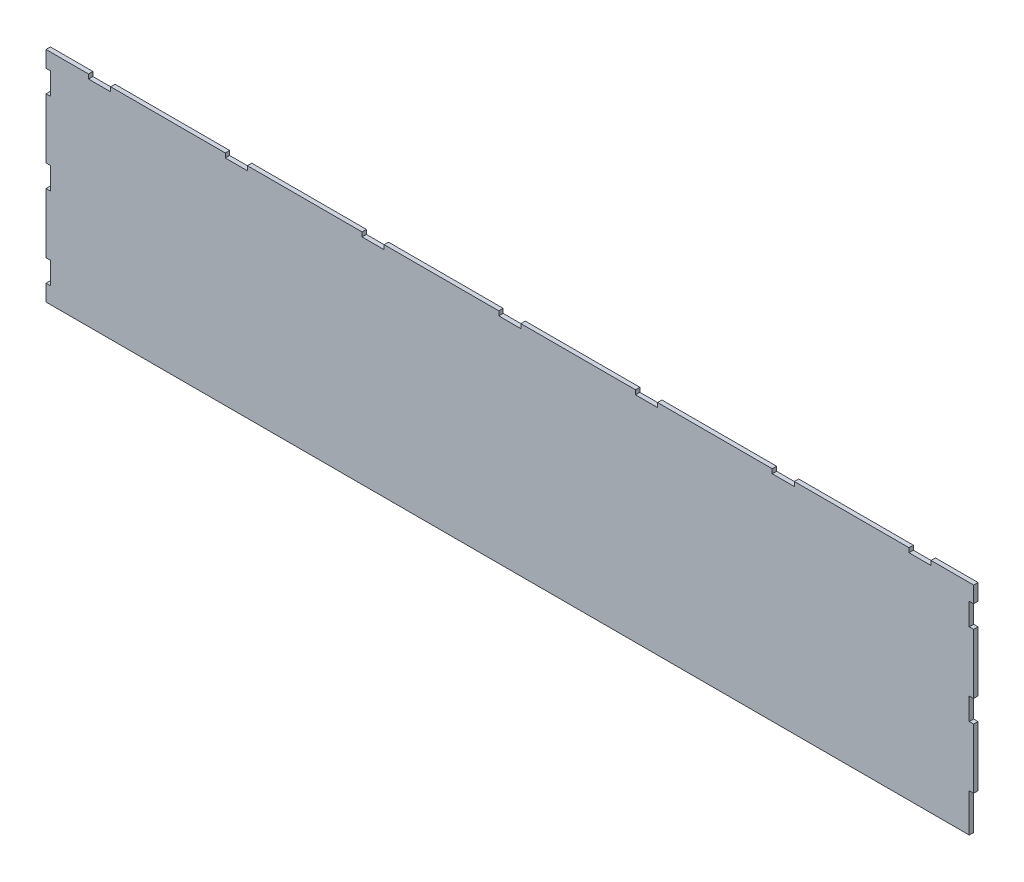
ISO-10303-21;
HEADER;
FILE_DESCRIPTION(('STEP AP214'),'2;1');
FILE_NAME('part.step','',(''),(''),'','','');
FILE_SCHEMA(('AUTOMOTIVE_DESIGN { 1 0 10303 214 1 1 1 1 }'));
ENDSEC;
DATA;
#1=APPLICATION_CONTEXT('core data for automotive mechanical design processes');
#2=APPLICATION_PROTOCOL_DEFINITION('international standard','automotive_design',2000,#1);
#3=PRODUCT_CONTEXT('',#1,'mechanical');
#4=PRODUCT('Part','Part','',(#3));
#5=PRODUCT_RELATED_PRODUCT_CATEGORY('part','',(#4));
#6=PRODUCT_DEFINITION_FORMATION('','',#4);
#7=PRODUCT_DEFINITION_CONTEXT('part definition',#1,'design');
#8=PRODUCT_DEFINITION('design','',#6,#7);
#9=PRODUCT_DEFINITION_SHAPE('','',#8);
#10=(LENGTH_UNIT() NAMED_UNIT(*) SI_UNIT(.MILLI.,.METRE.));
#11=(NAMED_UNIT(*) PLANE_ANGLE_UNIT() SI_UNIT($,.RADIAN.));
#12=(NAMED_UNIT(*) SI_UNIT($,.STERADIAN.) SOLID_ANGLE_UNIT());
#13=UNCERTAINTY_MEASURE_WITH_UNIT(LENGTH_MEASURE(1.E-05),#10,'distance_accuracy_value','');
#14=(GEOMETRIC_REPRESENTATION_CONTEXT(3) GLOBAL_UNCERTAINTY_ASSIGNED_CONTEXT((#13)) GLOBAL_UNIT_ASSIGNED_CONTEXT((#10,
#11,#12)) REPRESENTATION_CONTEXT('',''));
#15=CARTESIAN_POINT('',(0.,0.,0.));
#16=DIRECTION('',(0.,0.,1.));
#17=DIRECTION('',(1.,0.,0.));
#18=AXIS2_PLACEMENT_3D('',#15,#16,#17);
#19=CARTESIAN_POINT('',(424.,-100.,4.));
#20=DIRECTION('',(-1.,0.,0.));
#21=DIRECTION('',(0.,0.,1.));
#22=AXIS2_PLACEMENT_3D('',#19,#20,#21);
#23=PLANE('',#22);
#24=DIRECTION('',(0.,1.,0.));
#25=VECTOR('',#24,1.);
#26=CARTESIAN_POINT('',(424.,-100.,4.));
#27=LINE('',#26,#25);
#28=CARTESIAN_POINT('',(424.,-64.9,4.));
#29=VERTEX_POINT('',#28);
#30=CARTESIAN_POINT('',(424.,-10.1,4.));
#31=VERTEX_POINT('',#30);
#32=EDGE_CURVE('E856',#29,#31,#27,.T.);
#33=ORIENTED_EDGE('',*,*,#32,.F.);
#34=DIRECTION('',(0.,0.,1.));
#35=VECTOR('',#34,1.);
#36=CARTESIAN_POINT('',(424.,-64.9,0.));
#37=LINE('',#36,#35);
#38=CARTESIAN_POINT('',(424.,-64.9,0.));
#39=VERTEX_POINT('',#38);
#40=EDGE_CURVE('E621',#39,#29,#37,.T.);
#41=ORIENTED_EDGE('',*,*,#40,.F.);
#42=DIRECTION('',(0.,1.,0.));
#43=VECTOR('',#42,1.);
#44=CARTESIAN_POINT('',(424.,-100.,0.));
#45=LINE('',#44,#43);
#46=CARTESIAN_POINT('',(424.,-10.1,0.));
#47=VERTEX_POINT('',#46);
#48=EDGE_CURVE('E877',#39,#47,#45,.T.);
#49=ORIENTED_EDGE('',*,*,#48,.T.);
#50=DIRECTION('',(0.,0.,1.));
#51=VECTOR('',#50,1.);
#52=CARTESIAN_POINT('',(424.,-10.1,0.));
#53=LINE('',#52,#51);
#54=EDGE_CURVE('E764',#47,#31,#53,.T.);
#55=ORIENTED_EDGE('',*,*,#54,.T.);
#56=EDGE_LOOP('',(#33,#41,#49,#55));
#57=FACE_BOUND('',#56,.T.);
#58=ADVANCED_FACE('F42',(#57),#23,.F.);
#59=CARTESIAN_POINT('',(424.,10.1,4.));
#60=VERTEX_POINT('',#59);
#61=CARTESIAN_POINT('',(424.,64.9000000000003,4.));
#62=VERTEX_POINT('',#61);
#63=EDGE_CURVE('E854',#60,#62,#27,.T.);
#64=ORIENTED_EDGE('',*,*,#63,.F.);
#65=DIRECTION('',(0.,0.,1.));
#66=VECTOR('',#65,1.);
#67=CARTESIAN_POINT('',(424.,10.1,0.));
#68=LINE('',#67,#66);
#69=CARTESIAN_POINT('',(424.,10.1,0.));
#70=VERTEX_POINT('',#69);
#71=EDGE_CURVE('E794',#70,#60,#68,.T.);
#72=ORIENTED_EDGE('',*,*,#71,.F.);
#73=CARTESIAN_POINT('',(424.,64.9000000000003,0.));
#74=VERTEX_POINT('',#73);
#75=EDGE_CURVE('E876',#70,#74,#45,.T.);
#76=ORIENTED_EDGE('',*,*,#75,.T.);
#77=DIRECTION('',(0.,0.,1.));
#78=VECTOR('',#77,1.);
#79=CARTESIAN_POINT('',(424.,64.9000000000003,0.));
#80=LINE('',#79,#78);
#81=EDGE_CURVE('E728',#74,#62,#80,.T.);
#82=ORIENTED_EDGE('',*,*,#81,.T.);
#83=EDGE_LOOP('',(#64,#72,#76,#82));
#84=FACE_BOUND('',#83,.T.);
#85=ADVANCED_FACE('F938',(#84),#23,.F.);
#86=CARTESIAN_POINT('',(-424.,100.,4.));
#87=DIRECTION('',(0.,-1.,0.));
#88=DIRECTION('',(0.,0.,-1.));
#89=AXIS2_PLACEMENT_3D('',#86,#87,#88);
#90=PLANE('',#89);
#91=DIRECTION('',(-1.,0.,0.));
#92=VECTOR('',#91,1.);
#93=CARTESIAN_POINT('',(-424.,100.,4.));
#94=LINE('',#93,#92);
#95=CARTESIAN_POINT('',(-260.1,100.,4.));
#96=VERTEX_POINT('',#95);
#97=CARTESIAN_POINT('',(-364.9,100.,4.));
#98=VERTEX_POINT('',#97);
#99=EDGE_CURVE('E917',#96,#98,#94,.T.);
#100=ORIENTED_EDGE('',*,*,#99,.F.);
#101=DIRECTION('',(0.,0.,1.));
#102=VECTOR('',#101,1.);
#103=CARTESIAN_POINT('',(-260.1,100.,0.));
#104=LINE('',#103,#102);
#105=CARTESIAN_POINT('',(-260.1,100.,0.));
#106=VERTEX_POINT('',#105);
#107=EDGE_CURVE('E626',#106,#96,#104,.T.);
#108=ORIENTED_EDGE('',*,*,#107,.F.);
#109=DIRECTION('',(-1.,0.,0.));
#110=VECTOR('',#109,1.);
#111=CARTESIAN_POINT('',(-424.,100.,0.));
#112=LINE('',#111,#110);
#113=CARTESIAN_POINT('',(-364.9,100.,0.));
#114=VERTEX_POINT('',#113);
#115=EDGE_CURVE('E1027',#106,#114,#112,.T.);
#116=ORIENTED_EDGE('',*,*,#115,.T.);
#117=DIRECTION('',(0.,0.,1.));
#118=VECTOR('',#117,1.);
#119=CARTESIAN_POINT('',(-364.9,100.,0.));
#120=LINE('',#119,#118);
#121=EDGE_CURVE('E572',#114,#98,#120,.T.);
#122=ORIENTED_EDGE('',*,*,#121,.T.);
#123=EDGE_LOOP('',(#100,#108,#116,#122));
#124=FACE_BOUND('',#123,.T.);
#125=ADVANCED_FACE('F1025',(#124),#90,.F.);
#126=CARTESIAN_POINT('',(-385.1,100.,4.));
#127=VERTEX_POINT('',#126);
#128=CARTESIAN_POINT('',(-424.,100.,4.));
#129=VERTEX_POINT('',#128);
#130=EDGE_CURVE('E863',#127,#129,#94,.T.);
#131=ORIENTED_EDGE('',*,*,#130,.F.);
#132=DIRECTION('',(0.,0.,1.));
#133=VECTOR('',#132,1.);
#134=CARTESIAN_POINT('',(-385.1,100.,0.));
#135=LINE('',#134,#133);
#136=CARTESIAN_POINT('',(-385.1,100.,0.));
#137=VERTEX_POINT('',#136);
#138=EDGE_CURVE('E568',#137,#127,#135,.T.);
#139=ORIENTED_EDGE('',*,*,#138,.F.);
#140=CARTESIAN_POINT('',(-424.,100.,0.));
#141=VERTEX_POINT('',#140);
#142=EDGE_CURVE('E884',#137,#141,#112,.T.);
#143=ORIENTED_EDGE('',*,*,#142,.T.);
#144=DIRECTION('',(0.,0.,-1.));
#145=VECTOR('',#144,1.);
#146=CARTESIAN_POINT('',(-424.,100.,4.));
#147=LINE('',#146,#145);
#148=EDGE_CURVE('E51',#129,#141,#147,.T.);
#149=ORIENTED_EDGE('',*,*,#148,.F.);
#150=EDGE_LOOP('',(#131,#139,#143,#149));
#151=FACE_BOUND('',#150,.T.);
#152=ADVANCED_FACE('F1036',(#151),#90,.F.);
#153=CARTESIAN_POINT('',(-135.1,100.,0.));
#154=VERTEX_POINT('',#153);
#155=CARTESIAN_POINT('',(-239.9,100.,0.));
#156=VERTEX_POINT('',#155);
#157=EDGE_CURVE('E1013',#154,#156,#112,.T.);
#158=ORIENTED_EDGE('',*,*,#157,.T.);
#159=DIRECTION('',(0.,0.,1.));
#160=VECTOR('',#159,1.);
#161=CARTESIAN_POINT('',(-239.9,100.,0.));
#162=LINE('',#161,#160);
#163=CARTESIAN_POINT('',(-239.9,100.,4.));
#164=VERTEX_POINT('',#163);
#165=EDGE_CURVE('E662',#156,#164,#162,.T.);
#166=ORIENTED_EDGE('',*,*,#165,.T.);
#167=CARTESIAN_POINT('',(-135.1,100.,4.));
#168=VERTEX_POINT('',#167);
#169=EDGE_CURVE('E922',#168,#164,#94,.T.);
#170=ORIENTED_EDGE('',*,*,#169,.F.);
#171=DIRECTION('',(0.,0.,1.));
#172=VECTOR('',#171,1.);
#173=CARTESIAN_POINT('',(-135.1,100.,0.));
#174=LINE('',#173,#172);
#175=EDGE_CURVE('E562',#154,#168,#174,.T.);
#176=ORIENTED_EDGE('',*,*,#175,.F.);
#177=EDGE_LOOP('',(#158,#166,#170,#176));
#178=FACE_BOUND('',#177,.T.);
#179=ADVANCED_FACE('F1011',(#178),#90,.F.);
#180=CARTESIAN_POINT('',(-10.1,100.,0.));
#181=VERTEX_POINT('',#180);
#182=CARTESIAN_POINT('',(-114.9,100.,0.));
#183=VERTEX_POINT('',#182);
#184=EDGE_CURVE('E410',#181,#183,#112,.T.);
#185=ORIENTED_EDGE('',*,*,#184,.T.);
#186=DIRECTION('',(0.,0.,1.));
#187=VECTOR('',#186,1.);
#188=CARTESIAN_POINT('',(-114.9,100.,0.));
#189=LINE('',#188,#187);
#190=CARTESIAN_POINT('',(-114.9,100.,4.));
#191=VERTEX_POINT('',#190);
#192=EDGE_CURVE('E605',#183,#191,#189,.T.);
#193=ORIENTED_EDGE('',*,*,#192,.T.);
#194=CARTESIAN_POINT('',(-10.1,100.,4.));
#195=VERTEX_POINT('',#194);
#196=EDGE_CURVE('E990',#195,#191,#94,.T.);
#197=ORIENTED_EDGE('',*,*,#196,.F.);
#198=DIRECTION('',(0.,0.,1.));
#199=VECTOR('',#198,1.);
#200=CARTESIAN_POINT('',(-10.1,100.,0.));
#201=LINE('',#200,#199);
#202=EDGE_CURVE('E426',#181,#195,#201,.T.);
#203=ORIENTED_EDGE('',*,*,#202,.F.);
#204=EDGE_LOOP('',(#185,#193,#197,#203));
#205=FACE_BOUND('',#204,.T.);
#206=ADVANCED_FACE('F1203',(#205),#90,.F.);
#207=CARTESIAN_POINT('',(114.9,100.,0.));
#208=VERTEX_POINT('',#207);
#209=CARTESIAN_POINT('',(10.1,100.,0.));
#210=VERTEX_POINT('',#209);
#211=EDGE_CURVE('E1210',#208,#210,#112,.T.);
#212=ORIENTED_EDGE('',*,*,#211,.T.);
#213=DIRECTION('',(0.,0.,1.));
#214=VECTOR('',#213,1.);
#215=CARTESIAN_POINT('',(10.1,100.,0.));
#216=LINE('',#215,#214);
#217=CARTESIAN_POINT('',(10.1,100.,4.));
#218=VERTEX_POINT('',#217);
#219=EDGE_CURVE('E430',#210,#218,#216,.T.);
#220=ORIENTED_EDGE('',*,*,#219,.T.);
#221=CARTESIAN_POINT('',(114.9,100.,4.));
#222=VERTEX_POINT('',#221);
#223=EDGE_CURVE('E983',#222,#218,#94,.T.);
#224=ORIENTED_EDGE('',*,*,#223,.F.);
#225=DIRECTION('',(0.,0.,1.));
#226=VECTOR('',#225,1.);
#227=CARTESIAN_POINT('',(114.9,100.,0.));
#228=LINE('',#227,#226);
#229=EDGE_CURVE('E423',#208,#222,#228,.T.);
#230=ORIENTED_EDGE('',*,*,#229,.F.);
#231=EDGE_LOOP('',(#212,#220,#224,#230));
#232=FACE_BOUND('',#231,.T.);
#233=ADVANCED_FACE('F1198',(#232),#90,.F.);
#234=CARTESIAN_POINT('',(239.9,100.,0.));
#235=VERTEX_POINT('',#234);
#236=CARTESIAN_POINT('',(135.1,100.,0.));
#237=VERTEX_POINT('',#236);
#238=EDGE_CURVE('E1208',#235,#237,#112,.T.);
#239=ORIENTED_EDGE('',*,*,#238,.T.);
#240=DIRECTION('',(0.,0.,1.));
#241=VECTOR('',#240,1.);
#242=CARTESIAN_POINT('',(135.1,100.,0.));
#243=LINE('',#242,#241);
#244=CARTESIAN_POINT('',(135.1,100.,4.));
#245=VERTEX_POINT('',#244);
#246=EDGE_CURVE('E463',#237,#245,#243,.T.);
#247=ORIENTED_EDGE('',*,*,#246,.T.);
#248=CARTESIAN_POINT('',(239.9,100.,4.));
#249=VERTEX_POINT('',#248);
#250=EDGE_CURVE('E979',#249,#245,#94,.T.);
#251=ORIENTED_EDGE('',*,*,#250,.F.);
#252=DIRECTION('',(0.,0.,1.));
#253=VECTOR('',#252,1.);
#254=CARTESIAN_POINT('',(239.9,100.,0.));
#255=LINE('',#254,#253);
#256=EDGE_CURVE('E455',#235,#249,#255,.T.);
#257=ORIENTED_EDGE('',*,*,#256,.F.);
#258=EDGE_LOOP('',(#239,#247,#251,#257));
#259=FACE_BOUND('',#258,.T.);
#260=ADVANCED_FACE('F1194',(#259),#90,.F.);
#261=CARTESIAN_POINT('',(364.9,100.,0.));
#262=VERTEX_POINT('',#261);
#263=CARTESIAN_POINT('',(260.1,100.,0.));
#264=VERTEX_POINT('',#263);
#265=EDGE_CURVE('E883',#262,#264,#112,.T.);
#266=ORIENTED_EDGE('',*,*,#265,.T.);
#267=DIRECTION('',(0.,0.,1.));
#268=VECTOR('',#267,1.);
#269=CARTESIAN_POINT('',(260.1,100.,0.));
#270=LINE('',#269,#268);
#271=CARTESIAN_POINT('',(260.1,100.,4.));
#272=VERTEX_POINT('',#271);
#273=EDGE_CURVE('E499',#264,#272,#270,.T.);
#274=ORIENTED_EDGE('',*,*,#273,.T.);
#275=CARTESIAN_POINT('',(364.9,100.,4.));
#276=VERTEX_POINT('',#275);
#277=EDGE_CURVE('E862',#276,#272,#94,.T.);
#278=ORIENTED_EDGE('',*,*,#277,.F.);
#279=DIRECTION('',(0.,0.,1.));
#280=VECTOR('',#279,1.);
#281=CARTESIAN_POINT('',(364.9,100.,0.));
#282=LINE('',#281,#280);
#283=EDGE_CURVE('E491',#262,#276,#282,.T.);
#284=ORIENTED_EDGE('',*,*,#283,.F.);
#285=EDGE_LOOP('',(#266,#274,#278,#284));
#286=FACE_BOUND('',#285,.T.);
#287=ADVANCED_FACE('F976',(#286),#90,.F.);
#288=CARTESIAN_POINT('',(-424.,-100.,4.));
#289=DIRECTION('',(1.,0.,0.));
#290=DIRECTION('',(0.,0.,-1.));
#291=AXIS2_PLACEMENT_3D('',#288,#289,#290);
#292=PLANE('',#291);
#293=DIRECTION('',(0.,-1.,0.));
#294=VECTOR('',#293,1.);
#295=CARTESIAN_POINT('',(-424.,-100.,0.));
#296=LINE('',#295,#294);
#297=CARTESIAN_POINT('',(-424.,85.1,0.));
#298=VERTEX_POINT('',#297);
#299=EDGE_CURVE('E885',#141,#298,#296,.T.);
#300=ORIENTED_EDGE('',*,*,#299,.T.);
#301=DIRECTION('',(0.,0.,1.));
#302=VECTOR('',#301,1.);
#303=CARTESIAN_POINT('',(-424.,85.1,0.));
#304=LINE('',#303,#302);
#305=CARTESIAN_POINT('',(-424.,85.1,4.));
#306=VERTEX_POINT('',#305);
#307=EDGE_CURVE('E690',#298,#306,#304,.T.);
#308=ORIENTED_EDGE('',*,*,#307,.T.);
#309=DIRECTION('',(0.,-1.,0.));
#310=VECTOR('',#309,1.);
#311=CARTESIAN_POINT('',(-424.,-100.,4.));
#312=LINE('',#311,#310);
#313=EDGE_CURVE('E864',#129,#306,#312,.T.);
#314=ORIENTED_EDGE('',*,*,#313,.F.);
#315=ORIENTED_EDGE('',*,*,#148,.T.);
#316=EDGE_LOOP('',(#300,#308,#314,#315));
#317=FACE_BOUND('',#316,.T.);
#318=ADVANCED_FACE('F902',(#317),#292,.F.);
#319=CARTESIAN_POINT('',(-424.,64.9,4.));
#320=VERTEX_POINT('',#319);
#321=CARTESIAN_POINT('',(-424.,10.1,4.));
#322=VERTEX_POINT('',#321);
#323=EDGE_CURVE('E869',#320,#322,#312,.T.);
#324=ORIENTED_EDGE('',*,*,#323,.F.);
#325=DIRECTION('',(0.,0.,1.));
#326=VECTOR('',#325,1.);
#327=CARTESIAN_POINT('',(-424.,64.9,0.));
#328=LINE('',#327,#326);
#329=CARTESIAN_POINT('',(-424.,64.9,0.));
#330=VERTEX_POINT('',#329);
#331=EDGE_CURVE('E722',#330,#320,#328,.T.);
#332=ORIENTED_EDGE('',*,*,#331,.F.);
#333=CARTESIAN_POINT('',(-424.,10.1,0.));
#334=VERTEX_POINT('',#333);
#335=EDGE_CURVE('E889',#330,#334,#296,.T.);
#336=ORIENTED_EDGE('',*,*,#335,.T.);
#337=DIRECTION('',(0.,0.,1.));
#338=VECTOR('',#337,1.);
#339=CARTESIAN_POINT('',(-424.,10.1,0.));
#340=LINE('',#339,#338);
#341=EDGE_CURVE('E696',#334,#322,#340,.T.);
#342=ORIENTED_EDGE('',*,*,#341,.T.);
#343=EDGE_LOOP('',(#324,#332,#336,#342));
#344=FACE_BOUND('',#343,.T.);
#345=ADVANCED_FACE('F1173',(#344),#292,.F.);
#346=CARTESIAN_POINT('',(-424.,-10.1,4.));
#347=VERTEX_POINT('',#346);
#348=CARTESIAN_POINT('',(-424.,-64.9,4.));
#349=VERTEX_POINT('',#348);
#350=EDGE_CURVE('E1779',#347,#349,#312,.T.);
#351=ORIENTED_EDGE('',*,*,#350,.F.);
#352=DIRECTION('',(0.,0.,1.));
#353=VECTOR('',#352,1.);
#354=CARTESIAN_POINT('',(-424.,-10.1,0.));
#355=LINE('',#354,#353);
#356=CARTESIAN_POINT('',(-424.,-10.1,0.));
#357=VERTEX_POINT('',#356);
#358=EDGE_CURVE('E684',#357,#347,#355,.T.);
#359=ORIENTED_EDGE('',*,*,#358,.F.);
#360=CARTESIAN_POINT('',(-424.,-64.9,0.));
#361=VERTEX_POINT('',#360);
#362=EDGE_CURVE('E1781',#357,#361,#296,.T.);
#363=ORIENTED_EDGE('',*,*,#362,.T.);
#364=DIRECTION('',(0.,0.,1.));
#365=VECTOR('',#364,1.);
#366=CARTESIAN_POINT('',(-424.,-64.9,0.));
#367=LINE('',#366,#365);
#368=EDGE_CURVE('E838',#361,#349,#367,.T.);
#369=ORIENTED_EDGE('',*,*,#368,.T.);
#370=EDGE_LOOP('',(#351,#359,#363,#369));
#371=FACE_BOUND('',#370,.T.);
#372=ADVANCED_FACE('F1167',(#371),#292,.F.);
#373=CARTESIAN_POINT('',(424.,85.1,4.));
#374=VERTEX_POINT('',#373);
#375=CARTESIAN_POINT('',(424.,100.,4.));
#376=VERTEX_POINT('',#375);
#377=EDGE_CURVE('E851',#374,#376,#27,.T.);
#378=ORIENTED_EDGE('',*,*,#377,.F.);
#379=DIRECTION('',(0.,0.,1.));
#380=VECTOR('',#379,1.);
#381=CARTESIAN_POINT('',(424.,85.1,0.));
#382=LINE('',#381,#380);
#383=CARTESIAN_POINT('',(424.,85.1,0.));
#384=VERTEX_POINT('',#383);
#385=EDGE_CURVE('E758',#384,#374,#382,.T.);
#386=ORIENTED_EDGE('',*,*,#385,.F.);
#387=CARTESIAN_POINT('',(424.,100.,0.));
#388=VERTEX_POINT('',#387);
#389=EDGE_CURVE('E842',#384,#388,#45,.T.);
#390=ORIENTED_EDGE('',*,*,#389,.T.);
#391=DIRECTION('',(0.,0.,-1.));
#392=VECTOR('',#391,1.);
#393=CARTESIAN_POINT('',(424.,100.,4.));
#394=LINE('',#393,#392);
#395=EDGE_CURVE('E11',#376,#388,#394,.T.);
#396=ORIENTED_EDGE('',*,*,#395,.F.);
#397=EDGE_LOOP('',(#378,#386,#390,#396));
#398=FACE_BOUND('',#397,.T.);
#399=ADVANCED_FACE('F44',(#398),#23,.F.);
#400=CARTESIAN_POINT('',(385.1,100.,0.));
#401=VERTEX_POINT('',#400);
#402=EDGE_CURVE('E878',#388,#401,#112,.T.);
#403=ORIENTED_EDGE('',*,*,#402,.T.);
#404=DIRECTION('',(0.,0.,1.));
#405=VECTOR('',#404,1.);
#406=CARTESIAN_POINT('',(385.1,100.,0.));
#407=LINE('',#406,#405);
#408=CARTESIAN_POINT('',(385.1,100.,4.));
#409=VERTEX_POINT('',#408);
#410=EDGE_CURVE('E534',#401,#409,#407,.T.);
#411=ORIENTED_EDGE('',*,*,#410,.T.);
#412=EDGE_CURVE('E857',#376,#409,#94,.T.);
#413=ORIENTED_EDGE('',*,*,#412,.F.);
#414=ORIENTED_EDGE('',*,*,#395,.T.);
#415=EDGE_LOOP('',(#403,#411,#413,#414));
#416=FACE_BOUND('',#415,.T.);
#417=ADVANCED_FACE('F958',(#416),#90,.F.);
#418=CARTESIAN_POINT('',(-424.,-85.1,4.));
#419=VERTEX_POINT('',#418);
#420=CARTESIAN_POINT('',(-424.,-100.,4.));
#421=VERTEX_POINT('',#420);
#422=EDGE_CURVE('E861',#419,#421,#312,.T.);
#423=ORIENTED_EDGE('',*,*,#422,.F.);
#424=DIRECTION('',(0.,0.,1.));
#425=VECTOR('',#424,1.);
#426=CARTESIAN_POINT('',(-424.,-85.1,0.));
#427=LINE('',#426,#425);
#428=CARTESIAN_POINT('',(-424.,-85.1,0.));
#429=VERTEX_POINT('',#428);
#430=EDGE_CURVE('E828',#429,#419,#427,.T.);
#431=ORIENTED_EDGE('',*,*,#430,.F.);
#432=CARTESIAN_POINT('',(-424.,-100.,0.));
#433=VERTEX_POINT('',#432);
#434=EDGE_CURVE('E882',#429,#433,#296,.T.);
#435=ORIENTED_EDGE('',*,*,#434,.T.);
#436=DIRECTION('',(0.,0.,-1.));
#437=VECTOR('',#436,1.);
#438=CARTESIAN_POINT('',(-424.,-100.,4.));
#439=LINE('',#438,#437);
#440=EDGE_CURVE('E873',#421,#433,#439,.T.);
#441=ORIENTED_EDGE('',*,*,#440,.F.);
#442=EDGE_LOOP('',(#423,#431,#435,#441));
#443=FACE_BOUND('',#442,.T.);
#444=ADVANCED_FACE('F1172',(#443),#292,.F.);
#445=CARTESIAN_POINT('',(-424.,-100.,4.));
#446=DIRECTION('',(0.,1.,0.));
#447=DIRECTION('',(0.,0.,1.));
#448=AXIS2_PLACEMENT_3D('',#445,#446,#447);
#449=PLANE('',#448);
#450=DIRECTION('',(1.,0.,0.));
#451=VECTOR('',#450,1.);
#452=CARTESIAN_POINT('',(-424.,-100.,0.));
#453=LINE('',#452,#451);
#454=CARTESIAN_POINT('',(420.,-100.,0.));
#455=VERTEX_POINT('',#454);
#456=EDGE_CURVE('E855',#433,#455,#453,.T.);
#457=ORIENTED_EDGE('',*,*,#456,.T.);
#458=DIRECTION('',(0.,0.,1.));
#459=VECTOR('',#458,1.);
#460=CARTESIAN_POINT('',(420.,-100.,0.));
#461=LINE('',#460,#459);
#462=CARTESIAN_POINT('',(420.,-100.,4.));
#463=VERTEX_POINT('',#462);
#464=EDGE_CURVE('E629',#455,#463,#461,.T.);
#465=ORIENTED_EDGE('',*,*,#464,.T.);
#466=DIRECTION('',(1.,0.,0.));
#467=VECTOR('',#466,1.);
#468=CARTESIAN_POINT('',(-424.,-100.,4.));
#469=LINE('',#468,#467);
#470=EDGE_CURVE('E868',#421,#463,#469,.T.);
#471=ORIENTED_EDGE('',*,*,#470,.F.);
#472=ORIENTED_EDGE('',*,*,#440,.T.);
#473=EDGE_LOOP('',(#457,#465,#471,#472));
#474=FACE_BOUND('',#473,.T.);
#475=ADVANCED_FACE('F1183',(#474),#449,.F.);
#476=CARTESIAN_POINT('',(0.,0.,4.));
#477=DIRECTION('',(0.,0.,-1.));
#478=DIRECTION('',(-1.,0.,0.));
#479=AXIS2_PLACEMENT_3D('',#476,#477,#478);
#480=PLANE('',#479);
#481=ORIENTED_EDGE('',*,*,#470,.T.);
#482=DIRECTION('',(0.,-1.,0.));
#483=VECTOR('',#482,1.);
#484=CARTESIAN_POINT('',(420.,-64.9,4.));
#485=LINE('',#484,#483);
#486=CARTESIAN_POINT('',(420.,-64.9,4.));
#487=VERTEX_POINT('',#486);
#488=EDGE_CURVE('E618',#487,#463,#485,.T.);
#489=ORIENTED_EDGE('',*,*,#488,.F.);
#490=DIRECTION('',(-1.,0.,0.));
#491=VECTOR('',#490,1.);
#492=CARTESIAN_POINT('',(424.,-64.9,4.));
#493=LINE('',#492,#491);
#494=EDGE_CURVE('E622',#29,#487,#493,.T.);
#495=ORIENTED_EDGE('',*,*,#494,.F.);
#496=ORIENTED_EDGE('',*,*,#32,.T.);
#497=DIRECTION('',(1.,0.,0.));
#498=VECTOR('',#497,1.);
#499=CARTESIAN_POINT('',(424.,-10.1,4.));
#500=LINE('',#499,#498);
#501=CARTESIAN_POINT('',(420.,-10.1,4.));
#502=VERTEX_POINT('',#501);
#503=EDGE_CURVE('E786',#502,#31,#500,.T.);
#504=ORIENTED_EDGE('',*,*,#503,.F.);
#505=DIRECTION('',(0.,-1.,0.));
#506=VECTOR('',#505,1.);
#507=CARTESIAN_POINT('',(420.,10.1,4.));
#508=LINE('',#507,#506);
#509=CARTESIAN_POINT('',(420.,10.1,4.));
#510=VERTEX_POINT('',#509);
#511=EDGE_CURVE('E798',#510,#502,#508,.T.);
#512=ORIENTED_EDGE('',*,*,#511,.F.);
#513=DIRECTION('',(-1.,0.,0.));
#514=VECTOR('',#513,1.);
#515=CARTESIAN_POINT('',(424.,10.1,4.));
#516=LINE('',#515,#514);
#517=EDGE_CURVE('E633',#60,#510,#516,.T.);
#518=ORIENTED_EDGE('',*,*,#517,.F.);
#519=ORIENTED_EDGE('',*,*,#63,.T.);
#520=DIRECTION('',(1.,0.,0.));
#521=VECTOR('',#520,1.);
#522=CARTESIAN_POINT('',(424.,64.9000000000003,4.));
#523=LINE('',#522,#521);
#524=CARTESIAN_POINT('',(420.,64.9000000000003,4.));
#525=VERTEX_POINT('',#524);
#526=EDGE_CURVE('E750',#525,#62,#523,.T.);
#527=ORIENTED_EDGE('',*,*,#526,.F.);
#528=DIRECTION('',(0.,-1.,0.));
#529=VECTOR('',#528,1.);
#530=CARTESIAN_POINT('',(420.,85.1,4.));
#531=LINE('',#530,#529);
#532=CARTESIAN_POINT('',(420.,85.1,4.));
#533=VERTEX_POINT('',#532);
#534=EDGE_CURVE('E763',#533,#525,#531,.T.);
#535=ORIENTED_EDGE('',*,*,#534,.F.);
#536=DIRECTION('',(-1.,0.,0.));
#537=VECTOR('',#536,1.);
#538=CARTESIAN_POINT('',(424.,85.1,4.));
#539=LINE('',#538,#537);
#540=EDGE_CURVE('E759',#374,#533,#539,.T.);
#541=ORIENTED_EDGE('',*,*,#540,.F.);
#542=ORIENTED_EDGE('',*,*,#377,.T.);
#543=ORIENTED_EDGE('',*,*,#412,.T.);
#544=DIRECTION('',(0.,1.,0.));
#545=VECTOR('',#544,1.);
#546=CARTESIAN_POINT('',(385.1,100.,4.));
#547=LINE('',#546,#545);
#548=CARTESIAN_POINT('',(385.1,96.,4.));
#549=VERTEX_POINT('',#548);
#550=EDGE_CURVE('E513',#549,#409,#547,.T.);
#551=ORIENTED_EDGE('',*,*,#550,.F.);
#552=DIRECTION('',(1.,0.,0.));
#553=VECTOR('',#552,1.);
#554=CARTESIAN_POINT('',(364.9,96.,4.));
#555=LINE('',#554,#553);
#556=CARTESIAN_POINT('',(364.9,96.,4.));
#557=VERTEX_POINT('',#556);
#558=EDGE_CURVE('E526',#557,#549,#555,.T.);
#559=ORIENTED_EDGE('',*,*,#558,.F.);
#560=DIRECTION('',(0.,-1.,0.));
#561=VECTOR('',#560,1.);
#562=CARTESIAN_POINT('',(364.9,100.,4.));
#563=LINE('',#562,#561);
#564=EDGE_CURVE('E522',#276,#557,#563,.T.);
#565=ORIENTED_EDGE('',*,*,#564,.F.);
#566=ORIENTED_EDGE('',*,*,#277,.T.);
#567=DIRECTION('',(0.,1.,0.));
#568=VECTOR('',#567,1.);
#569=CARTESIAN_POINT('',(260.1,100.,4.));
#570=LINE('',#569,#568);
#571=CARTESIAN_POINT('',(260.1,96.,4.));
#572=VERTEX_POINT('',#571);
#573=EDGE_CURVE('E477',#572,#272,#570,.T.);
#574=ORIENTED_EDGE('',*,*,#573,.F.);
#575=DIRECTION('',(1.,0.,0.));
#576=VECTOR('',#575,1.);
#577=CARTESIAN_POINT('',(239.9,96.,4.));
#578=LINE('',#577,#576);
#579=CARTESIAN_POINT('',(239.9,96.,4.));
#580=VERTEX_POINT('',#579);
#581=EDGE_CURVE('E490',#580,#572,#578,.T.);
#582=ORIENTED_EDGE('',*,*,#581,.F.);
#583=DIRECTION('',(0.,-1.,0.));
#584=VECTOR('',#583,1.);
#585=CARTESIAN_POINT('',(239.9,100.,4.));
#586=LINE('',#585,#584);
#587=EDGE_CURVE('E486',#249,#580,#586,.T.);
#588=ORIENTED_EDGE('',*,*,#587,.F.);
#589=ORIENTED_EDGE('',*,*,#250,.T.);
#590=DIRECTION('',(0.,1.,0.));
#591=VECTOR('',#590,1.);
#592=CARTESIAN_POINT('',(135.1,100.,4.));
#593=LINE('',#592,#591);
#594=CARTESIAN_POINT('',(135.1,96.,4.));
#595=VERTEX_POINT('',#594);
#596=EDGE_CURVE('E441',#595,#245,#593,.T.);
#597=ORIENTED_EDGE('',*,*,#596,.F.);
#598=DIRECTION('',(1.,0.,0.));
#599=VECTOR('',#598,1.);
#600=CARTESIAN_POINT('',(114.9,96.,4.));
#601=LINE('',#600,#599);
#602=CARTESIAN_POINT('',(114.9,96.,4.));
#603=VERTEX_POINT('',#602);
#604=EDGE_CURVE('E454',#603,#595,#601,.T.);
#605=ORIENTED_EDGE('',*,*,#604,.F.);
#606=DIRECTION('',(0.,-1.,0.));
#607=VECTOR('',#606,1.);
#608=CARTESIAN_POINT('',(114.9,100.,4.));
#609=LINE('',#608,#607);
#610=EDGE_CURVE('E450',#222,#603,#609,.T.);
#611=ORIENTED_EDGE('',*,*,#610,.F.);
#612=ORIENTED_EDGE('',*,*,#223,.T.);
#613=DIRECTION('',(0.,1.,0.));
#614=VECTOR('',#613,1.);
#615=CARTESIAN_POINT('',(10.1,100.,4.));
#616=LINE('',#615,#614);
#617=CARTESIAN_POINT('',(10.1,96.,4.));
#618=VERTEX_POINT('',#617);
#619=EDGE_CURVE('E412',#618,#218,#616,.T.);
#620=ORIENTED_EDGE('',*,*,#619,.F.);
#621=DIRECTION('',(1.,0.,0.));
#622=VECTOR('',#621,1.);
#623=CARTESIAN_POINT('',(-10.1,96.,4.));
#624=LINE('',#623,#622);
#625=CARTESIAN_POINT('',(-10.1,96.,4.));
#626=VERTEX_POINT('',#625);
#627=EDGE_CURVE('E416',#626,#618,#624,.T.);
#628=ORIENTED_EDGE('',*,*,#627,.F.);
#629=DIRECTION('',(0.,-1.,0.));
#630=VECTOR('',#629,1.);
#631=CARTESIAN_POINT('',(-10.1,100.,4.));
#632=LINE('',#631,#630);
#633=EDGE_CURVE('E390',#195,#626,#632,.T.);
#634=ORIENTED_EDGE('',*,*,#633,.F.);
#635=ORIENTED_EDGE('',*,*,#196,.T.);
#636=DIRECTION('',(0.,1.,0.));
#637=VECTOR('',#636,1.);
#638=CARTESIAN_POINT('',(-114.9,100.,4.));
#639=LINE('',#638,#637);
#640=CARTESIAN_POINT('',(-114.9,96.,4.));
#641=VERTEX_POINT('',#640);
#642=EDGE_CURVE('E586',#641,#191,#639,.T.);
#643=ORIENTED_EDGE('',*,*,#642,.F.);
#644=DIRECTION('',(1.,0.,0.));
#645=VECTOR('',#644,1.);
#646=CARTESIAN_POINT('',(-135.1,96.,4.));
#647=LINE('',#646,#645);
#648=CARTESIAN_POINT('',(-135.1,96.,4.));
#649=VERTEX_POINT('',#648);
#650=EDGE_CURVE('E597',#649,#641,#647,.T.);
#651=ORIENTED_EDGE('',*,*,#650,.F.);
#652=DIRECTION('',(0.,-1.,0.));
#653=VECTOR('',#652,1.);
#654=CARTESIAN_POINT('',(-135.1,100.,4.));
#655=LINE('',#654,#653);
#656=EDGE_CURVE('E429',#168,#649,#655,.T.);
#657=ORIENTED_EDGE('',*,*,#656,.F.);
#658=ORIENTED_EDGE('',*,*,#169,.T.);
#659=DIRECTION('',(0.,1.,0.));
#660=VECTOR('',#659,1.);
#661=CARTESIAN_POINT('',(-239.9,100.,4.));
#662=LINE('',#661,#660);
#663=CARTESIAN_POINT('',(-239.9,96.,4.));
#664=VERTEX_POINT('',#663);
#665=EDGE_CURVE('E644',#664,#164,#662,.T.);
#666=ORIENTED_EDGE('',*,*,#665,.F.);
#667=DIRECTION('',(1.,0.,0.));
#668=VECTOR('',#667,1.);
#669=CARTESIAN_POINT('',(-260.1,96.,4.));
#670=LINE('',#669,#668);
#671=CARTESIAN_POINT('',(-260.1,96.,4.));
#672=VERTEX_POINT('',#671);
#673=EDGE_CURVE('E654',#672,#664,#670,.T.);
#674=ORIENTED_EDGE('',*,*,#673,.F.);
#675=DIRECTION('',(0.,-1.,0.));
#676=VECTOR('',#675,1.);
#677=CARTESIAN_POINT('',(-260.1,100.,4.));
#678=LINE('',#677,#676);
#679=EDGE_CURVE('E571',#96,#672,#678,.T.);
#680=ORIENTED_EDGE('',*,*,#679,.F.);
#681=ORIENTED_EDGE('',*,*,#99,.T.);
#682=DIRECTION('',(0.,1.,0.));
#683=VECTOR('',#682,1.);
#684=CARTESIAN_POINT('',(-364.9,100.,4.));
#685=LINE('',#684,#683);
#686=CARTESIAN_POINT('',(-364.9,96.,4.));
#687=VERTEX_POINT('',#686);
#688=EDGE_CURVE('E548',#687,#98,#685,.T.);
#689=ORIENTED_EDGE('',*,*,#688,.F.);
#690=DIRECTION('',(1.,0.,0.));
#691=VECTOR('',#690,1.);
#692=CARTESIAN_POINT('',(-385.1,96.,4.));
#693=LINE('',#692,#691);
#694=CARTESIAN_POINT('',(-385.1,96.,4.));
#695=VERTEX_POINT('',#694);
#696=EDGE_CURVE('E561',#695,#687,#693,.T.);
#697=ORIENTED_EDGE('',*,*,#696,.F.);
#698=DIRECTION('',(0.,-1.,0.));
#699=VECTOR('',#698,1.);
#700=CARTESIAN_POINT('',(-385.1,100.,4.));
#701=LINE('',#700,#699);
#702=EDGE_CURVE('E557',#127,#695,#701,.T.);
#703=ORIENTED_EDGE('',*,*,#702,.F.);
#704=ORIENTED_EDGE('',*,*,#130,.T.);
#705=ORIENTED_EDGE('',*,*,#313,.T.);
#706=DIRECTION('',(-1.,0.,0.));
#707=VECTOR('',#706,1.);
#708=CARTESIAN_POINT('',(-424.,85.1,4.));
#709=LINE('',#708,#707);
#710=CARTESIAN_POINT('',(-420.,85.1,4.));
#711=VERTEX_POINT('',#710);
#712=EDGE_CURVE('E714',#711,#306,#709,.T.);
#713=ORIENTED_EDGE('',*,*,#712,.F.);
#714=DIRECTION('',(0.,1.,0.));
#715=VECTOR('',#714,1.);
#716=CARTESIAN_POINT('',(-420.,85.1,4.));
#717=LINE('',#716,#715);
#718=CARTESIAN_POINT('',(-420.,64.9,4.));
#719=VERTEX_POINT('',#718);
#720=EDGE_CURVE('E727',#719,#711,#717,.T.);
#721=ORIENTED_EDGE('',*,*,#720,.F.);
#722=DIRECTION('',(1.,0.,0.));
#723=VECTOR('',#722,1.);
#724=CARTESIAN_POINT('',(-424.,64.9,4.));
#725=LINE('',#724,#723);
#726=EDGE_CURVE('E723',#320,#719,#725,.T.);
#727=ORIENTED_EDGE('',*,*,#726,.F.);
#728=ORIENTED_EDGE('',*,*,#323,.T.);
#729=DIRECTION('',(-1.,0.,0.));
#730=VECTOR('',#729,1.);
#731=CARTESIAN_POINT('',(-424.,10.1,4.));
#732=LINE('',#731,#730);
#733=CARTESIAN_POINT('',(-420.,10.1,4.));
#734=VERTEX_POINT('',#733);
#735=EDGE_CURVE('E676',#734,#322,#732,.T.);
#736=ORIENTED_EDGE('',*,*,#735,.F.);
#737=DIRECTION('',(0.,1.,0.));
#738=VECTOR('',#737,1.);
#739=CARTESIAN_POINT('',(-420.,-10.1,4.));
#740=LINE('',#739,#738);
#741=CARTESIAN_POINT('',(-420.,-10.1,4.));
#742=VERTEX_POINT('',#741);
#743=EDGE_CURVE('E689',#742,#734,#740,.T.);
#744=ORIENTED_EDGE('',*,*,#743,.F.);
#745=DIRECTION('',(1.,0.,0.));
#746=VECTOR('',#745,1.);
#747=CARTESIAN_POINT('',(-424.,-10.1,4.));
#748=LINE('',#747,#746);
#749=EDGE_CURVE('E685',#347,#742,#748,.T.);
#750=ORIENTED_EDGE('',*,*,#749,.F.);
#751=ORIENTED_EDGE('',*,*,#350,.T.);
#752=DIRECTION('',(-1.,0.,0.));
#753=VECTOR('',#752,1.);
#754=CARTESIAN_POINT('',(-424.,-64.9,4.));
#755=LINE('',#754,#753);
#756=CARTESIAN_POINT('',(-420.,-64.9,4.));
#757=VERTEX_POINT('',#756);
#758=EDGE_CURVE('E820',#757,#349,#755,.T.);
#759=ORIENTED_EDGE('',*,*,#758,.F.);
#760=DIRECTION('',(0.,1.,0.));
#761=VECTOR('',#760,1.);
#762=CARTESIAN_POINT('',(-420.,-85.1,4.));
#763=LINE('',#762,#761);
#764=CARTESIAN_POINT('',(-420.,-85.1,4.));
#765=VERTEX_POINT('',#764);
#766=EDGE_CURVE('E832',#765,#757,#763,.T.);
#767=ORIENTED_EDGE('',*,*,#766,.F.);
#768=DIRECTION('',(1.,0.,0.));
#769=VECTOR('',#768,1.);
#770=CARTESIAN_POINT('',(-424.,-85.1,4.));
#771=LINE('',#770,#769);
#772=EDGE_CURVE('E700',#419,#765,#771,.T.);
#773=ORIENTED_EDGE('',*,*,#772,.F.);
#774=ORIENTED_EDGE('',*,*,#422,.T.);
#775=EDGE_LOOP('',(#481,#489,#495,#496,#504,#512,#518,#519,#527,#535,#541,#542,#543,#551,#559,
#565,#566,#574,#582,#588,#589,#597,#605,#611,#612,#620,#628,#634,#635,#643,#651,#657,#658,#666,
#674,#680,#681,#689,#697,#703,#704,#705,#713,#721,#727,#728,#736,#744,#750,#751,#759,#767,#773,#774));
#776=FACE_BOUND('',#775,.T.);
#777=ADVANCED_FACE('F911',(#776),#480,.F.);
#778=CARTESIAN_POINT('',(0.,0.,0.));
#779=DIRECTION('',(0.,0.,-1.));
#780=DIRECTION('',(-1.,0.,0.));
#781=AXIS2_PLACEMENT_3D('',#778,#779,#780);
#782=PLANE('',#781);
#783=DIRECTION('',(0.,-1.,0.));
#784=VECTOR('',#783,1.);
#785=CARTESIAN_POINT('',(420.,-64.9,0.));
#786=LINE('',#785,#784);
#787=CARTESIAN_POINT('',(420.,-64.9,0.));
#788=VERTEX_POINT('',#787);
#789=EDGE_CURVE('E58',#788,#455,#786,.T.);
#790=ORIENTED_EDGE('',*,*,#789,.T.);
#791=ORIENTED_EDGE('',*,*,#456,.F.);
#792=ORIENTED_EDGE('',*,*,#434,.F.);
#793=DIRECTION('',(1.,0.,0.));
#794=VECTOR('',#793,1.);
#795=CARTESIAN_POINT('',(-424.,-85.1,0.));
#796=LINE('',#795,#794);
#797=CARTESIAN_POINT('',(-420.,-85.1,0.));
#798=VERTEX_POINT('',#797);
#799=EDGE_CURVE('E815',#429,#798,#796,.T.);
#800=ORIENTED_EDGE('',*,*,#799,.T.);
#801=DIRECTION('',(0.,1.,0.));
#802=VECTOR('',#801,1.);
#803=CARTESIAN_POINT('',(-420.,-85.1,0.));
#804=LINE('',#803,#802);
#805=CARTESIAN_POINT('',(-420.,-64.9,0.));
#806=VERTEX_POINT('',#805);
#807=EDGE_CURVE('E819',#798,#806,#804,.T.);
#808=ORIENTED_EDGE('',*,*,#807,.T.);
#809=DIRECTION('',(-1.,0.,0.));
#810=VECTOR('',#809,1.);
#811=CARTESIAN_POINT('',(-424.,-64.9,0.));
#812=LINE('',#811,#810);
#813=EDGE_CURVE('E824',#806,#361,#812,.T.);
#814=ORIENTED_EDGE('',*,*,#813,.T.);
#815=ORIENTED_EDGE('',*,*,#362,.F.);
#816=DIRECTION('',(1.,0.,0.));
#817=VECTOR('',#816,1.);
#818=CARTESIAN_POINT('',(-424.,-10.1,0.));
#819=LINE('',#818,#817);
#820=CARTESIAN_POINT('',(-420.,-10.1,0.));
#821=VERTEX_POINT('',#820);
#822=EDGE_CURVE('E671',#357,#821,#819,.T.);
#823=ORIENTED_EDGE('',*,*,#822,.T.);
#824=DIRECTION('',(0.,1.,0.));
#825=VECTOR('',#824,1.);
#826=CARTESIAN_POINT('',(-420.,-10.1,0.));
#827=LINE('',#826,#825);
#828=CARTESIAN_POINT('',(-420.,10.1,0.));
#829=VERTEX_POINT('',#828);
#830=EDGE_CURVE('E675',#821,#829,#827,.T.);
#831=ORIENTED_EDGE('',*,*,#830,.T.);
#832=DIRECTION('',(-1.,0.,0.));
#833=VECTOR('',#832,1.);
#834=CARTESIAN_POINT('',(-424.,10.1,0.));
#835=LINE('',#834,#833);
#836=EDGE_CURVE('E680',#829,#334,#835,.T.);
#837=ORIENTED_EDGE('',*,*,#836,.T.);
#838=ORIENTED_EDGE('',*,*,#335,.F.);
#839=DIRECTION('',(1.,0.,0.));
#840=VECTOR('',#839,1.);
#841=CARTESIAN_POINT('',(-424.,64.9,0.));
#842=LINE('',#841,#840);
#843=CARTESIAN_POINT('',(-420.,64.9,0.));
#844=VERTEX_POINT('',#843);
#845=EDGE_CURVE('E709',#330,#844,#842,.T.);
#846=ORIENTED_EDGE('',*,*,#845,.T.);
#847=DIRECTION('',(0.,1.,0.));
#848=VECTOR('',#847,1.);
#849=CARTESIAN_POINT('',(-420.,85.1,0.));
#850=LINE('',#849,#848);
#851=CARTESIAN_POINT('',(-420.,85.1,0.));
#852=VERTEX_POINT('',#851);
#853=EDGE_CURVE('E713',#844,#852,#850,.T.);
#854=ORIENTED_EDGE('',*,*,#853,.T.);
#855=DIRECTION('',(-1.,0.,0.));
#856=VECTOR('',#855,1.);
#857=CARTESIAN_POINT('',(-424.,85.1,0.));
#858=LINE('',#857,#856);
#859=EDGE_CURVE('E718',#852,#298,#858,.T.);
#860=ORIENTED_EDGE('',*,*,#859,.T.);
#861=ORIENTED_EDGE('',*,*,#299,.F.);
#862=ORIENTED_EDGE('',*,*,#142,.F.);
#863=DIRECTION('',(0.,-1.,0.));
#864=VECTOR('',#863,1.);
#865=CARTESIAN_POINT('',(-385.1,100.,0.));
#866=LINE('',#865,#864);
#867=CARTESIAN_POINT('',(-385.1,96.,0.));
#868=VERTEX_POINT('',#867);
#869=EDGE_CURVE('E543',#137,#868,#866,.T.);
#870=ORIENTED_EDGE('',*,*,#869,.T.);
#871=DIRECTION('',(1.,0.,0.));
#872=VECTOR('',#871,1.);
#873=CARTESIAN_POINT('',(-385.1,96.,0.));
#874=LINE('',#873,#872);
#875=CARTESIAN_POINT('',(-364.9,96.,0.));
#876=VERTEX_POINT('',#875);
#877=EDGE_CURVE('E547',#868,#876,#874,.T.);
#878=ORIENTED_EDGE('',*,*,#877,.T.);
#879=DIRECTION('',(0.,1.,0.));
#880=VECTOR('',#879,1.);
#881=CARTESIAN_POINT('',(-364.9,100.,0.));
#882=LINE('',#881,#880);
#883=EDGE_CURVE('E552',#876,#114,#882,.T.);
#884=ORIENTED_EDGE('',*,*,#883,.T.);
#885=ORIENTED_EDGE('',*,*,#115,.F.);
#886=DIRECTION('',(0.,-1.,0.));
#887=VECTOR('',#886,1.);
#888=CARTESIAN_POINT('',(-260.1,100.,0.));
#889=LINE('',#888,#887);
#890=CARTESIAN_POINT('',(-260.1,96.,0.));
#891=VERTEX_POINT('',#890);
#892=EDGE_CURVE('E639',#106,#891,#889,.T.);
#893=ORIENTED_EDGE('',*,*,#892,.T.);
#894=DIRECTION('',(1.,0.,0.));
#895=VECTOR('',#894,1.);
#896=CARTESIAN_POINT('',(-260.1,96.,0.));
#897=LINE('',#896,#895);
#898=CARTESIAN_POINT('',(-239.9,96.,0.));
#899=VERTEX_POINT('',#898);
#900=EDGE_CURVE('E643',#891,#899,#897,.T.);
#901=ORIENTED_EDGE('',*,*,#900,.T.);
#902=DIRECTION('',(0.,1.,0.));
#903=VECTOR('',#902,1.);
#904=CARTESIAN_POINT('',(-239.9,100.,0.));
#905=LINE('',#904,#903);
#906=EDGE_CURVE('E66',#899,#156,#905,.T.);
#907=ORIENTED_EDGE('',*,*,#906,.T.);
#908=ORIENTED_EDGE('',*,*,#157,.F.);
#909=DIRECTION('',(0.,-1.,0.));
#910=VECTOR('',#909,1.);
#911=CARTESIAN_POINT('',(-135.1,100.,0.));
#912=LINE('',#911,#910);
#913=CARTESIAN_POINT('',(-135.1,96.,0.));
#914=VERTEX_POINT('',#913);
#915=EDGE_CURVE('E581',#154,#914,#912,.T.);
#916=ORIENTED_EDGE('',*,*,#915,.T.);
#917=DIRECTION('',(1.,0.,0.));
#918=VECTOR('',#917,1.);
#919=CARTESIAN_POINT('',(-135.1,96.,0.));
#920=LINE('',#919,#918);
#921=CARTESIAN_POINT('',(-114.9,96.,0.));
#922=VERTEX_POINT('',#921);
#923=EDGE_CURVE('E585',#914,#922,#920,.T.);
#924=ORIENTED_EDGE('',*,*,#923,.T.);
#925=DIRECTION('',(0.,1.,0.));
#926=VECTOR('',#925,1.);
#927=CARTESIAN_POINT('',(-114.9,100.,0.));
#928=LINE('',#927,#926);
#929=EDGE_CURVE('E590',#922,#183,#928,.T.);
#930=ORIENTED_EDGE('',*,*,#929,.T.);
#931=ORIENTED_EDGE('',*,*,#184,.F.);
#932=DIRECTION('',(0.,-1.,0.));
#933=VECTOR('',#932,1.);
#934=CARTESIAN_POINT('',(-10.1,100.,0.));
#935=LINE('',#934,#933);
#936=CARTESIAN_POINT('',(-10.1,96.,0.));
#937=VERTEX_POINT('',#936);
#938=EDGE_CURVE('E387',#181,#937,#935,.T.);
#939=ORIENTED_EDGE('',*,*,#938,.T.);
#940=DIRECTION('',(1.,0.,0.));
#941=VECTOR('',#940,1.);
#942=CARTESIAN_POINT('',(-10.1,96.,0.));
#943=LINE('',#942,#941);
#944=CARTESIAN_POINT('',(10.1,96.,0.));
#945=VERTEX_POINT('',#944);
#946=EDGE_CURVE('E400',#937,#945,#943,.T.);
#947=ORIENTED_EDGE('',*,*,#946,.T.);
#948=DIRECTION('',(0.,1.,0.));
#949=VECTOR('',#948,1.);
#950=CARTESIAN_POINT('',(10.1,100.,0.));
#951=LINE('',#950,#949);
#952=EDGE_CURVE('E396',#945,#210,#951,.T.);
#953=ORIENTED_EDGE('',*,*,#952,.T.);
#954=ORIENTED_EDGE('',*,*,#211,.F.);
#955=DIRECTION('',(0.,-1.,0.));
#956=VECTOR('',#955,1.);
#957=CARTESIAN_POINT('',(114.9,100.,0.));
#958=LINE('',#957,#956);
#959=CARTESIAN_POINT('',(114.9,96.,0.));
#960=VERTEX_POINT('',#959);
#961=EDGE_CURVE('E436',#208,#960,#958,.T.);
#962=ORIENTED_EDGE('',*,*,#961,.T.);
#963=DIRECTION('',(1.,0.,0.));
#964=VECTOR('',#963,1.);
#965=CARTESIAN_POINT('',(114.9,96.,0.));
#966=LINE('',#965,#964);
#967=CARTESIAN_POINT('',(135.1,96.,0.));
#968=VERTEX_POINT('',#967);
#969=EDGE_CURVE('E440',#960,#968,#966,.T.);
#970=ORIENTED_EDGE('',*,*,#969,.T.);
#971=DIRECTION('',(0.,1.,0.));
#972=VECTOR('',#971,1.);
#973=CARTESIAN_POINT('',(135.1,100.,0.));
#974=LINE('',#973,#972);
#975=EDGE_CURVE('E445',#968,#237,#974,.T.);
#976=ORIENTED_EDGE('',*,*,#975,.T.);
#977=ORIENTED_EDGE('',*,*,#238,.F.);
#978=DIRECTION('',(0.,-1.,0.));
#979=VECTOR('',#978,1.);
#980=CARTESIAN_POINT('',(239.9,100.,0.));
#981=LINE('',#980,#979);
#982=CARTESIAN_POINT('',(239.9,96.,0.));
#983=VERTEX_POINT('',#982);
#984=EDGE_CURVE('E472',#235,#983,#981,.T.);
#985=ORIENTED_EDGE('',*,*,#984,.T.);
#986=DIRECTION('',(1.,0.,0.));
#987=VECTOR('',#986,1.);
#988=CARTESIAN_POINT('',(239.9,96.,0.));
#989=LINE('',#988,#987);
#990=CARTESIAN_POINT('',(260.1,96.,0.));
#991=VERTEX_POINT('',#990);
#992=EDGE_CURVE('E476',#983,#991,#989,.T.);
#993=ORIENTED_EDGE('',*,*,#992,.T.);
#994=DIRECTION('',(0.,1.,0.));
#995=VECTOR('',#994,1.);
#996=CARTESIAN_POINT('',(260.1,100.,0.));
#997=LINE('',#996,#995);
#998=EDGE_CURVE('E481',#991,#264,#997,.T.);
#999=ORIENTED_EDGE('',*,*,#998,.T.);
#1000=ORIENTED_EDGE('',*,*,#265,.F.);
#1001=DIRECTION('',(0.,-1.,0.));
#1002=VECTOR('',#1001,1.);
#1003=CARTESIAN_POINT('',(364.9,100.,0.));
#1004=LINE('',#1003,#1002);
#1005=CARTESIAN_POINT('',(364.9,96.,0.));
#1006=VERTEX_POINT('',#1005);
#1007=EDGE_CURVE('E508',#262,#1006,#1004,.T.);
#1008=ORIENTED_EDGE('',*,*,#1007,.T.);
#1009=DIRECTION('',(1.,0.,0.));
#1010=VECTOR('',#1009,1.);
#1011=CARTESIAN_POINT('',(364.9,96.,0.));
#1012=LINE('',#1011,#1010);
#1013=CARTESIAN_POINT('',(385.1,96.,0.));
#1014=VERTEX_POINT('',#1013);
#1015=EDGE_CURVE('E512',#1006,#1014,#1012,.T.);
#1016=ORIENTED_EDGE('',*,*,#1015,.T.);
#1017=DIRECTION('',(0.,1.,0.));
#1018=VECTOR('',#1017,1.);
#1019=CARTESIAN_POINT('',(385.1,100.,0.));
#1020=LINE('',#1019,#1018);
#1021=EDGE_CURVE('E517',#1014,#401,#1020,.T.);
#1022=ORIENTED_EDGE('',*,*,#1021,.T.);
#1023=ORIENTED_EDGE('',*,*,#402,.F.);
#1024=ORIENTED_EDGE('',*,*,#389,.F.);
#1025=DIRECTION('',(-1.,0.,0.));
#1026=VECTOR('',#1025,1.);
#1027=CARTESIAN_POINT('',(424.,85.1,0.));
#1028=LINE('',#1027,#1026);
#1029=CARTESIAN_POINT('',(420.,85.1,0.));
#1030=VERTEX_POINT('',#1029);
#1031=EDGE_CURVE('E745',#384,#1030,#1028,.T.);
#1032=ORIENTED_EDGE('',*,*,#1031,.T.);
#1033=DIRECTION('',(0.,-1.,0.));
#1034=VECTOR('',#1033,1.);
#1035=CARTESIAN_POINT('',(420.,85.1,0.));
#1036=LINE('',#1035,#1034);
#1037=CARTESIAN_POINT('',(420.,64.9000000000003,0.));
#1038=VERTEX_POINT('',#1037);
#1039=EDGE_CURVE('E749',#1030,#1038,#1036,.T.);
#1040=ORIENTED_EDGE('',*,*,#1039,.T.);
#1041=DIRECTION('',(1.,0.,0.));
#1042=VECTOR('',#1041,1.);
#1043=CARTESIAN_POINT('',(424.,64.9000000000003,0.));
#1044=LINE('',#1043,#1042);
#1045=EDGE_CURVE('E754',#1038,#74,#1044,.T.);
#1046=ORIENTED_EDGE('',*,*,#1045,.T.);
#1047=ORIENTED_EDGE('',*,*,#75,.F.);
#1048=DIRECTION('',(-1.,0.,0.));
#1049=VECTOR('',#1048,1.);
#1050=CARTESIAN_POINT('',(424.,10.1,0.));
#1051=LINE('',#1050,#1049);
#1052=CARTESIAN_POINT('',(420.,10.1,0.));
#1053=VERTEX_POINT('',#1052);
#1054=EDGE_CURVE('E781',#70,#1053,#1051,.T.);
#1055=ORIENTED_EDGE('',*,*,#1054,.T.);
#1056=DIRECTION('',(0.,-1.,0.));
#1057=VECTOR('',#1056,1.);
#1058=CARTESIAN_POINT('',(420.,10.1,0.));
#1059=LINE('',#1058,#1057);
#1060=CARTESIAN_POINT('',(420.,-10.1,0.));
#1061=VERTEX_POINT('',#1060);
#1062=EDGE_CURVE('E785',#1053,#1061,#1059,.T.);
#1063=ORIENTED_EDGE('',*,*,#1062,.T.);
#1064=DIRECTION('',(1.,0.,0.));
#1065=VECTOR('',#1064,1.);
#1066=CARTESIAN_POINT('',(424.,-10.1,0.));
#1067=LINE('',#1066,#1065);
#1068=EDGE_CURVE('E790',#1061,#47,#1067,.T.);
#1069=ORIENTED_EDGE('',*,*,#1068,.T.);
#1070=ORIENTED_EDGE('',*,*,#48,.F.);
#1071=DIRECTION('',(-1.,0.,0.));
#1072=VECTOR('',#1071,1.);
#1073=CARTESIAN_POINT('',(424.,-64.9,0.));
#1074=LINE('',#1073,#1072);
#1075=EDGE_CURVE('E614',#39,#788,#1074,.T.);
#1076=ORIENTED_EDGE('',*,*,#1075,.T.);
#1077=EDGE_LOOP('',(#790,#791,#792,#800,#808,#814,#815,#823,#831,#837,#838,#846,#854,#860,#861,
#862,#870,#878,#884,#885,#893,#901,#907,#908,#916,#924,#930,#931,#939,#947,#953,#954,#962,#970,
#976,#977,#985,#993,#999,#1000,#1008,#1016,#1022,#1023,#1024,#1032,#1040,#1046,#1047,#1055,
#1063,#1069,#1070,#1076));
#1078=FACE_BOUND('',#1077,.T.);
#1079=ADVANCED_FACE('F407',(#1078),#782,.T.);
#1080=CARTESIAN_POINT('',(-424.,-64.9,0.));
#1081=DIRECTION('',(0.,1.,0.));
#1082=DIRECTION('',(0.,0.,1.));
#1083=AXIS2_PLACEMENT_3D('',#1080,#1081,#1082);
#1084=PLANE('',#1083);
#1085=ORIENTED_EDGE('',*,*,#758,.T.);
#1086=ORIENTED_EDGE('',*,*,#368,.F.);
#1087=ORIENTED_EDGE('',*,*,#813,.F.);
#1088=DIRECTION('',(0.,0.,1.));
#1089=VECTOR('',#1088,1.);
#1090=CARTESIAN_POINT('',(-420.,-64.9,0.));
#1091=LINE('',#1090,#1089);
#1092=EDGE_CURVE('E843',#806,#757,#1091,.T.);
#1093=ORIENTED_EDGE('',*,*,#1092,.T.);
#1094=EDGE_LOOP('',(#1085,#1086,#1087,#1093));
#1095=FACE_BOUND('',#1094,.T.);
#1096=ADVANCED_FACE('F1577',(#1095),#1084,.F.);
#1097=CARTESIAN_POINT('',(-420.,-85.1,0.));
#1098=DIRECTION('',(1.,0.,0.));
#1099=DIRECTION('',(0.,0.,-1.));
#1100=AXIS2_PLACEMENT_3D('',#1097,#1098,#1099);
#1101=PLANE('',#1100);
#1102=ORIENTED_EDGE('',*,*,#766,.T.);
#1103=ORIENTED_EDGE('',*,*,#1092,.F.);
#1104=ORIENTED_EDGE('',*,*,#807,.F.);
#1105=DIRECTION('',(0.,0.,1.));
#1106=VECTOR('',#1105,1.);
#1107=CARTESIAN_POINT('',(-420.,-85.1,0.));
#1108=LINE('',#1107,#1106);
#1109=EDGE_CURVE('E846',#798,#765,#1108,.T.);
#1110=ORIENTED_EDGE('',*,*,#1109,.T.);
#1111=EDGE_LOOP('',(#1102,#1103,#1104,#1110));
#1112=FACE_BOUND('',#1111,.T.);
#1113=ADVANCED_FACE('F1567',(#1112),#1101,.F.);
#1114=CARTESIAN_POINT('',(-424.,-85.1,0.));
#1115=DIRECTION('',(0.,-1.,0.));
#1116=DIRECTION('',(0.,0.,-1.));
#1117=AXIS2_PLACEMENT_3D('',#1114,#1115,#1116);
#1118=PLANE('',#1117);
#1119=ORIENTED_EDGE('',*,*,#772,.T.);
#1120=ORIENTED_EDGE('',*,*,#1109,.F.);
#1121=ORIENTED_EDGE('',*,*,#799,.F.);
#1122=ORIENTED_EDGE('',*,*,#430,.T.);
#1123=EDGE_LOOP('',(#1119,#1120,#1121,#1122));
#1124=FACE_BOUND('',#1123,.T.);
#1125=ADVANCED_FACE('F1264',(#1124),#1118,.F.);
#1126=CARTESIAN_POINT('',(364.9,100.,0.));
#1127=DIRECTION('',(-1.,0.,0.));
#1128=DIRECTION('',(0.,0.,1.));
#1129=AXIS2_PLACEMENT_3D('',#1126,#1127,#1128);
#1130=PLANE('',#1129);
#1131=ORIENTED_EDGE('',*,*,#564,.T.);
#1132=DIRECTION('',(0.,0.,1.));
#1133=VECTOR('',#1132,1.);
#1134=CARTESIAN_POINT('',(364.9,96.,0.));
#1135=LINE('',#1134,#1133);
#1136=EDGE_CURVE('E521',#1006,#557,#1135,.T.);
#1137=ORIENTED_EDGE('',*,*,#1136,.F.);
#1138=ORIENTED_EDGE('',*,*,#1007,.F.);
#1139=ORIENTED_EDGE('',*,*,#283,.T.);
#1140=EDGE_LOOP('',(#1131,#1137,#1138,#1139));
#1141=FACE_BOUND('',#1140,.T.);
#1142=ADVANCED_FACE('F969',(#1141),#1130,.F.);
#1143=CARTESIAN_POINT('',(385.1,100.,0.));
#1144=DIRECTION('',(1.,0.,0.));
#1145=DIRECTION('',(0.,0.,-1.));
#1146=AXIS2_PLACEMENT_3D('',#1143,#1144,#1145);
#1147=PLANE('',#1146);
#1148=ORIENTED_EDGE('',*,*,#550,.T.);
#1149=ORIENTED_EDGE('',*,*,#410,.F.);
#1150=ORIENTED_EDGE('',*,*,#1021,.F.);
#1151=DIRECTION('',(0.,0.,1.));
#1152=VECTOR('',#1151,1.);
#1153=CARTESIAN_POINT('',(385.1,96.,0.));
#1154=LINE('',#1153,#1152);
#1155=EDGE_CURVE('E538',#1014,#549,#1154,.T.);
#1156=ORIENTED_EDGE('',*,*,#1155,.T.);
#1157=EDGE_LOOP('',(#1148,#1149,#1150,#1156));
#1158=FACE_BOUND('',#1157,.T.);
#1159=ADVANCED_FACE('F963',(#1158),#1147,.F.);
#1160=CARTESIAN_POINT('',(364.9,96.,0.));
#1161=DIRECTION('',(0.,-1.,0.));
#1162=DIRECTION('',(0.,0.,-1.));
#1163=AXIS2_PLACEMENT_3D('',#1160,#1161,#1162);
#1164=PLANE('',#1163);
#1165=ORIENTED_EDGE('',*,*,#558,.T.);
#1166=ORIENTED_EDGE('',*,*,#1155,.F.);
#1167=ORIENTED_EDGE('',*,*,#1015,.F.);
#1168=ORIENTED_EDGE('',*,*,#1136,.T.);
#1169=EDGE_LOOP('',(#1165,#1166,#1167,#1168));
#1170=FACE_BOUND('',#1169,.T.);
#1171=ADVANCED_FACE('F967',(#1170),#1164,.F.);
#1172=CARTESIAN_POINT('',(239.9,100.,0.));
#1173=DIRECTION('',(-1.,0.,0.));
#1174=DIRECTION('',(0.,0.,1.));
#1175=AXIS2_PLACEMENT_3D('',#1172,#1173,#1174);
#1176=PLANE('',#1175);
#1177=ORIENTED_EDGE('',*,*,#587,.T.);
#1178=DIRECTION('',(0.,0.,1.));
#1179=VECTOR('',#1178,1.);
#1180=CARTESIAN_POINT('',(239.9,96.,0.));
#1181=LINE('',#1180,#1179);
#1182=EDGE_CURVE('E485',#983,#580,#1181,.T.);
#1183=ORIENTED_EDGE('',*,*,#1182,.F.);
#1184=ORIENTED_EDGE('',*,*,#984,.F.);
#1185=ORIENTED_EDGE('',*,*,#256,.T.);
#1186=EDGE_LOOP('',(#1177,#1183,#1184,#1185));
#1187=FACE_BOUND('',#1186,.T.);
#1188=ADVANCED_FACE('F1250',(#1187),#1176,.F.);
#1189=CARTESIAN_POINT('',(260.1,100.,0.));
#1190=DIRECTION('',(1.,0.,0.));
#1191=DIRECTION('',(0.,0.,-1.));
#1192=AXIS2_PLACEMENT_3D('',#1189,#1190,#1191);
#1193=PLANE('',#1192);
#1194=ORIENTED_EDGE('',*,*,#573,.T.);
#1195=ORIENTED_EDGE('',*,*,#273,.F.);
#1196=ORIENTED_EDGE('',*,*,#998,.F.);
#1197=DIRECTION('',(0.,0.,1.));
#1198=VECTOR('',#1197,1.);
#1199=CARTESIAN_POINT('',(260.1,96.,0.));
#1200=LINE('',#1199,#1198);
#1201=EDGE_CURVE('E503',#991,#572,#1200,.T.);
#1202=ORIENTED_EDGE('',*,*,#1201,.T.);
#1203=EDGE_LOOP('',(#1194,#1195,#1196,#1202));
#1204=FACE_BOUND('',#1203,.T.);
#1205=ADVANCED_FACE('F1247',(#1204),#1193,.F.);
#1206=CARTESIAN_POINT('',(239.9,96.,0.));
#1207=DIRECTION('',(0.,-1.,0.));
#1208=DIRECTION('',(0.,0.,-1.));
#1209=AXIS2_PLACEMENT_3D('',#1206,#1207,#1208);
#1210=PLANE('',#1209);
#1211=ORIENTED_EDGE('',*,*,#581,.T.);
#1212=ORIENTED_EDGE('',*,*,#1201,.F.);
#1213=ORIENTED_EDGE('',*,*,#992,.F.);
#1214=ORIENTED_EDGE('',*,*,#1182,.T.);
#1215=EDGE_LOOP('',(#1211,#1212,#1213,#1214));
#1216=FACE_BOUND('',#1215,.T.);
#1217=ADVANCED_FACE('F1242',(#1216),#1210,.F.);
#1218=CARTESIAN_POINT('',(114.9,100.,0.));
#1219=DIRECTION('',(-1.,0.,0.));
#1220=DIRECTION('',(0.,0.,1.));
#1221=AXIS2_PLACEMENT_3D('',#1218,#1219,#1220);
#1222=PLANE('',#1221);
#1223=ORIENTED_EDGE('',*,*,#610,.T.);
#1224=DIRECTION('',(0.,0.,1.));
#1225=VECTOR('',#1224,1.);
#1226=CARTESIAN_POINT('',(114.9,96.,0.));
#1227=LINE('',#1226,#1225);
#1228=EDGE_CURVE('E449',#960,#603,#1227,.T.);
#1229=ORIENTED_EDGE('',*,*,#1228,.F.);
#1230=ORIENTED_EDGE('',*,*,#961,.F.);
#1231=ORIENTED_EDGE('',*,*,#229,.T.);
#1232=EDGE_LOOP('',(#1223,#1229,#1230,#1231));
#1233=FACE_BOUND('',#1232,.T.);
#1234=ADVANCED_FACE('F1228',(#1233),#1222,.F.);
#1235=CARTESIAN_POINT('',(135.1,100.,0.));
#1236=DIRECTION('',(1.,0.,0.));
#1237=DIRECTION('',(0.,0.,-1.));
#1238=AXIS2_PLACEMENT_3D('',#1235,#1236,#1237);
#1239=PLANE('',#1238);
#1240=ORIENTED_EDGE('',*,*,#596,.T.);
#1241=ORIENTED_EDGE('',*,*,#246,.F.);
#1242=ORIENTED_EDGE('',*,*,#975,.F.);
#1243=DIRECTION('',(0.,0.,1.));
#1244=VECTOR('',#1243,1.);
#1245=CARTESIAN_POINT('',(135.1,96.,0.));
#1246=LINE('',#1245,#1244);
#1247=EDGE_CURVE('E467',#968,#595,#1246,.T.);
#1248=ORIENTED_EDGE('',*,*,#1247,.T.);
#1249=EDGE_LOOP('',(#1240,#1241,#1242,#1248));
#1250=FACE_BOUND('',#1249,.T.);
#1251=ADVANCED_FACE('F1234',(#1250),#1239,.F.);
#1252=CARTESIAN_POINT('',(114.9,96.,0.));
#1253=DIRECTION('',(0.,-1.,0.));
#1254=DIRECTION('',(0.,0.,-1.));
#1255=AXIS2_PLACEMENT_3D('',#1252,#1253,#1254);
#1256=PLANE('',#1255);
#1257=ORIENTED_EDGE('',*,*,#604,.T.);
#1258=ORIENTED_EDGE('',*,*,#1247,.F.);
#1259=ORIENTED_EDGE('',*,*,#969,.F.);
#1260=ORIENTED_EDGE('',*,*,#1228,.T.);
#1261=EDGE_LOOP('',(#1257,#1258,#1259,#1260));
#1262=FACE_BOUND('',#1261,.T.);
#1263=ADVANCED_FACE('F1232',(#1262),#1256,.F.);
#1264=CARTESIAN_POINT('',(-10.1,100.,0.));
#1265=DIRECTION('',(-1.,0.,0.));
#1266=DIRECTION('',(0.,0.,1.));
#1267=AXIS2_PLACEMENT_3D('',#1264,#1265,#1266);
#1268=PLANE('',#1267);
#1269=ORIENTED_EDGE('',*,*,#633,.T.);
#1270=DIRECTION('',(0.,0.,1.));
#1271=VECTOR('',#1270,1.);
#1272=CARTESIAN_POINT('',(-10.1,96.,0.));
#1273=LINE('',#1272,#1271);
#1274=EDGE_CURVE('E383',#937,#626,#1273,.T.);
#1275=ORIENTED_EDGE('',*,*,#1274,.F.);
#1276=ORIENTED_EDGE('',*,*,#938,.F.);
#1277=ORIENTED_EDGE('',*,*,#202,.T.);
#1278=EDGE_LOOP('',(#1269,#1275,#1276,#1277));
#1279=FACE_BOUND('',#1278,.T.);
#1280=ADVANCED_FACE('F385',(#1279),#1268,.F.);
#1281=CARTESIAN_POINT('',(10.1,100.,0.));
#1282=DIRECTION('',(1.,0.,0.));
#1283=DIRECTION('',(0.,0.,-1.));
#1284=AXIS2_PLACEMENT_3D('',#1281,#1282,#1283);
#1285=PLANE('',#1284);
#1286=ORIENTED_EDGE('',*,*,#619,.T.);
#1287=ORIENTED_EDGE('',*,*,#219,.F.);
#1288=ORIENTED_EDGE('',*,*,#952,.F.);
#1289=DIRECTION('',(0.,0.,1.));
#1290=VECTOR('',#1289,1.);
#1291=CARTESIAN_POINT('',(10.1,96.,0.));
#1292=LINE('',#1291,#1290);
#1293=EDGE_CURVE('E395',#945,#618,#1292,.T.);
#1294=ORIENTED_EDGE('',*,*,#1293,.T.);
#1295=EDGE_LOOP('',(#1286,#1287,#1288,#1294));
#1296=FACE_BOUND('',#1295,.T.);
#1297=ADVANCED_FACE('F1225',(#1296),#1285,.F.);
#1298=CARTESIAN_POINT('',(-10.1,96.,0.));
#1299=DIRECTION('',(0.,-1.,0.));
#1300=DIRECTION('',(0.,0.,-1.));
#1301=AXIS2_PLACEMENT_3D('',#1298,#1299,#1300);
#1302=PLANE('',#1301);
#1303=ORIENTED_EDGE('',*,*,#627,.T.);
#1304=ORIENTED_EDGE('',*,*,#1293,.F.);
#1305=ORIENTED_EDGE('',*,*,#946,.F.);
#1306=ORIENTED_EDGE('',*,*,#1274,.T.);
#1307=EDGE_LOOP('',(#1303,#1304,#1305,#1306));
#1308=FACE_BOUND('',#1307,.T.);
#1309=ADVANCED_FACE('F401',(#1308),#1302,.F.);
#1310=CARTESIAN_POINT('',(-424.,10.1,0.));
#1311=DIRECTION('',(0.,1.,0.));
#1312=DIRECTION('',(0.,0.,1.));
#1313=AXIS2_PLACEMENT_3D('',#1310,#1311,#1312);
#1314=PLANE('',#1313);
#1315=ORIENTED_EDGE('',*,*,#735,.T.);
#1316=ORIENTED_EDGE('',*,*,#341,.F.);
#1317=ORIENTED_EDGE('',*,*,#836,.F.);
#1318=DIRECTION('',(0.,0.,1.));
#1319=VECTOR('',#1318,1.);
#1320=CARTESIAN_POINT('',(-420.,10.1,0.));
#1321=LINE('',#1320,#1319);
#1322=EDGE_CURVE('E701',#829,#734,#1321,.T.);
#1323=ORIENTED_EDGE('',*,*,#1322,.T.);
#1324=EDGE_LOOP('',(#1315,#1316,#1317,#1323));
#1325=FACE_BOUND('',#1324,.T.);
#1326=ADVANCED_FACE('F1292',(#1325),#1314,.F.);
#1327=CARTESIAN_POINT('',(-420.,-10.1,0.));
#1328=DIRECTION('',(1.,0.,0.));
#1329=DIRECTION('',(0.,0.,-1.));
#1330=AXIS2_PLACEMENT_3D('',#1327,#1328,#1329);
#1331=PLANE('',#1330);
#1332=ORIENTED_EDGE('',*,*,#743,.T.);
#1333=ORIENTED_EDGE('',*,*,#1322,.F.);
#1334=ORIENTED_EDGE('',*,*,#830,.F.);
#1335=DIRECTION('',(0.,0.,1.));
#1336=VECTOR('',#1335,1.);
#1337=CARTESIAN_POINT('',(-420.,-10.1,0.));
#1338=LINE('',#1337,#1336);
#1339=EDGE_CURVE('E704',#821,#742,#1338,.T.);
#1340=ORIENTED_EDGE('',*,*,#1339,.T.);
#1341=EDGE_LOOP('',(#1332,#1333,#1334,#1340));
#1342=FACE_BOUND('',#1341,.T.);
#1343=ADVANCED_FACE('F1295',(#1342),#1331,.F.);
#1344=CARTESIAN_POINT('',(-424.,-10.1,0.));
#1345=DIRECTION('',(0.,-1.,0.));
#1346=DIRECTION('',(0.,0.,-1.));
#1347=AXIS2_PLACEMENT_3D('',#1344,#1345,#1346);
#1348=PLANE('',#1347);
#1349=ORIENTED_EDGE('',*,*,#749,.T.);
#1350=ORIENTED_EDGE('',*,*,#1339,.F.);
#1351=ORIENTED_EDGE('',*,*,#822,.F.);
#1352=ORIENTED_EDGE('',*,*,#358,.T.);
#1353=EDGE_LOOP('',(#1349,#1350,#1351,#1352));
#1354=FACE_BOUND('',#1353,.T.);
#1355=ADVANCED_FACE('F1299',(#1354),#1348,.F.);
#1356=CARTESIAN_POINT('',(-424.,85.1,0.));
#1357=DIRECTION('',(0.,1.,0.));
#1358=DIRECTION('',(0.,0.,1.));
#1359=AXIS2_PLACEMENT_3D('',#1356,#1357,#1358);
#1360=PLANE('',#1359);
#1361=ORIENTED_EDGE('',*,*,#712,.T.);
#1362=ORIENTED_EDGE('',*,*,#307,.F.);
#1363=ORIENTED_EDGE('',*,*,#859,.F.);
#1364=DIRECTION('',(0.,0.,1.));
#1365=VECTOR('',#1364,1.);
#1366=CARTESIAN_POINT('',(-420.,85.1,0.));
#1367=LINE('',#1366,#1365);
#1368=EDGE_CURVE('E737',#852,#711,#1367,.T.);
#1369=ORIENTED_EDGE('',*,*,#1368,.T.);
#1370=EDGE_LOOP('',(#1361,#1362,#1363,#1369));
#1371=FACE_BOUND('',#1370,.T.);
#1372=ADVANCED_FACE('F908',(#1371),#1360,.F.);
#1373=CARTESIAN_POINT('',(-420.,85.1,0.));
#1374=DIRECTION('',(1.,0.,0.));
#1375=DIRECTION('',(0.,0.,-1.));
#1376=AXIS2_PLACEMENT_3D('',#1373,#1374,#1375);
#1377=PLANE('',#1376);
#1378=ORIENTED_EDGE('',*,*,#720,.T.);
#1379=ORIENTED_EDGE('',*,*,#1368,.F.);
#1380=ORIENTED_EDGE('',*,*,#853,.F.);
#1381=DIRECTION('',(0.,0.,1.));
#1382=VECTOR('',#1381,1.);
#1383=CARTESIAN_POINT('',(-420.,64.9,0.));
#1384=LINE('',#1383,#1382);
#1385=EDGE_CURVE('E740',#844,#719,#1384,.T.);
#1386=ORIENTED_EDGE('',*,*,#1385,.T.);
#1387=EDGE_LOOP('',(#1378,#1379,#1380,#1386));
#1388=FACE_BOUND('',#1387,.T.);
#1389=ADVANCED_FACE('F1306',(#1388),#1377,.F.);
#1390=CARTESIAN_POINT('',(-424.,64.9,0.));
#1391=DIRECTION('',(0.,-1.,0.));
#1392=DIRECTION('',(0.,0.,-1.));
#1393=AXIS2_PLACEMENT_3D('',#1390,#1391,#1392);
#1394=PLANE('',#1393);
#1395=ORIENTED_EDGE('',*,*,#726,.T.);
#1396=ORIENTED_EDGE('',*,*,#1385,.F.);
#1397=ORIENTED_EDGE('',*,*,#845,.F.);
#1398=ORIENTED_EDGE('',*,*,#331,.T.);
#1399=EDGE_LOOP('',(#1395,#1396,#1397,#1398));
#1400=FACE_BOUND('',#1399,.T.);
#1401=ADVANCED_FACE('F1309',(#1400),#1394,.F.);
#1402=CARTESIAN_POINT('',(424.,64.9000000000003,0.));
#1403=DIRECTION('',(0.,-1.,0.));
#1404=DIRECTION('',(0.,0.,-1.));
#1405=AXIS2_PLACEMENT_3D('',#1402,#1403,#1404);
#1406=PLANE('',#1405);
#1407=ORIENTED_EDGE('',*,*,#526,.T.);
#1408=ORIENTED_EDGE('',*,*,#81,.F.);
#1409=ORIENTED_EDGE('',*,*,#1045,.F.);
#1410=DIRECTION('',(0.,0.,1.));
#1411=VECTOR('',#1410,1.);
#1412=CARTESIAN_POINT('',(420.,64.9000000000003,0.));
#1413=LINE('',#1412,#1411);
#1414=EDGE_CURVE('E773',#1038,#525,#1413,.T.);
#1415=ORIENTED_EDGE('',*,*,#1414,.T.);
#1416=EDGE_LOOP('',(#1407,#1408,#1409,#1415));
#1417=FACE_BOUND('',#1416,.T.);
#1418=ADVANCED_FACE('F943',(#1417),#1406,.F.);
#1419=CARTESIAN_POINT('',(420.,85.1,0.));
#1420=DIRECTION('',(-1.,0.,0.));
#1421=DIRECTION('',(0.,0.,1.));
#1422=AXIS2_PLACEMENT_3D('',#1419,#1420,#1421);
#1423=PLANE('',#1422);
#1424=ORIENTED_EDGE('',*,*,#534,.T.);
#1425=ORIENTED_EDGE('',*,*,#1414,.F.);
#1426=ORIENTED_EDGE('',*,*,#1039,.F.);
#1427=DIRECTION('',(0.,0.,1.));
#1428=VECTOR('',#1427,1.);
#1429=CARTESIAN_POINT('',(420.,85.1,0.));
#1430=LINE('',#1429,#1428);
#1431=EDGE_CURVE('E776',#1030,#533,#1430,.T.);
#1432=ORIENTED_EDGE('',*,*,#1431,.T.);
#1433=EDGE_LOOP('',(#1424,#1425,#1426,#1432));
#1434=FACE_BOUND('',#1433,.T.);
#1435=ADVANCED_FACE('F947',(#1434),#1423,.F.);
#1436=CARTESIAN_POINT('',(424.,85.1,0.));
#1437=DIRECTION('',(0.,1.,0.));
#1438=DIRECTION('',(0.,0.,1.));
#1439=AXIS2_PLACEMENT_3D('',#1436,#1437,#1438);
#1440=PLANE('',#1439);
#1441=ORIENTED_EDGE('',*,*,#540,.T.);
#1442=ORIENTED_EDGE('',*,*,#1431,.F.);
#1443=ORIENTED_EDGE('',*,*,#1031,.F.);
#1444=ORIENTED_EDGE('',*,*,#385,.T.);
#1445=EDGE_LOOP('',(#1441,#1442,#1443,#1444));
#1446=FACE_BOUND('',#1445,.T.);
#1447=ADVANCED_FACE('F949',(#1446),#1440,.F.);
#1448=CARTESIAN_POINT('',(424.,-10.1,0.));
#1449=DIRECTION('',(0.,-1.,0.));
#1450=DIRECTION('',(0.,0.,-1.));
#1451=AXIS2_PLACEMENT_3D('',#1448,#1449,#1450);
#1452=PLANE('',#1451);
#1453=ORIENTED_EDGE('',*,*,#503,.T.);
#1454=ORIENTED_EDGE('',*,*,#54,.F.);
#1455=ORIENTED_EDGE('',*,*,#1068,.F.);
#1456=DIRECTION('',(0.,0.,1.));
#1457=VECTOR('',#1456,1.);
#1458=CARTESIAN_POINT('',(420.,-10.1,0.));
#1459=LINE('',#1458,#1457);
#1460=EDGE_CURVE('E807',#1061,#502,#1459,.T.);
#1461=ORIENTED_EDGE('',*,*,#1460,.T.);
#1462=EDGE_LOOP('',(#1453,#1454,#1455,#1461));
#1463=FACE_BOUND('',#1462,.T.);
#1464=ADVANCED_FACE('F1144',(#1463),#1452,.F.);
#1465=CARTESIAN_POINT('',(420.,10.1,0.));
#1466=DIRECTION('',(-1.,0.,0.));
#1467=DIRECTION('',(0.,0.,1.));
#1468=AXIS2_PLACEMENT_3D('',#1465,#1466,#1467);
#1469=PLANE('',#1468);
#1470=ORIENTED_EDGE('',*,*,#511,.T.);
#1471=ORIENTED_EDGE('',*,*,#1460,.F.);
#1472=ORIENTED_EDGE('',*,*,#1062,.F.);
#1473=DIRECTION('',(0.,0.,1.));
#1474=VECTOR('',#1473,1.);
#1475=CARTESIAN_POINT('',(420.,10.1,0.));
#1476=LINE('',#1475,#1474);
#1477=EDGE_CURVE('E810',#1053,#510,#1476,.T.);
#1478=ORIENTED_EDGE('',*,*,#1477,.T.);
#1479=EDGE_LOOP('',(#1470,#1471,#1472,#1478));
#1480=FACE_BOUND('',#1479,.T.);
#1481=ADVANCED_FACE('F1146',(#1480),#1469,.F.);
#1482=CARTESIAN_POINT('',(424.,10.1,0.));
#1483=DIRECTION('',(0.,1.,0.));
#1484=DIRECTION('',(0.,0.,1.));
#1485=AXIS2_PLACEMENT_3D('',#1482,#1483,#1484);
#1486=PLANE('',#1485);
#1487=ORIENTED_EDGE('',*,*,#517,.T.);
#1488=ORIENTED_EDGE('',*,*,#1477,.F.);
#1489=ORIENTED_EDGE('',*,*,#1054,.F.);
#1490=ORIENTED_EDGE('',*,*,#71,.T.);
#1491=EDGE_LOOP('',(#1487,#1488,#1489,#1490));
#1492=FACE_BOUND('',#1491,.T.);
#1493=ADVANCED_FACE('F1149',(#1492),#1486,.F.);
#1494=CARTESIAN_POINT('',(-135.1,100.,0.));
#1495=DIRECTION('',(-1.,0.,0.));
#1496=DIRECTION('',(0.,0.,1.));
#1497=AXIS2_PLACEMENT_3D('',#1494,#1495,#1496);
#1498=PLANE('',#1497);
#1499=ORIENTED_EDGE('',*,*,#656,.T.);
#1500=DIRECTION('',(0.,0.,1.));
#1501=VECTOR('',#1500,1.);
#1502=CARTESIAN_POINT('',(-135.1,96.,0.));
#1503=LINE('',#1502,#1501);
#1504=EDGE_CURVE('E593',#914,#649,#1503,.T.);
#1505=ORIENTED_EDGE('',*,*,#1504,.F.);
#1506=ORIENTED_EDGE('',*,*,#915,.F.);
#1507=ORIENTED_EDGE('',*,*,#175,.T.);
#1508=EDGE_LOOP('',(#1499,#1505,#1506,#1507));
#1509=FACE_BOUND('',#1508,.T.);
#1510=ADVANCED_FACE('F1151',(#1509),#1498,.F.);
#1511=CARTESIAN_POINT('',(-114.9,100.,0.));
#1512=DIRECTION('',(1.,0.,0.));
#1513=DIRECTION('',(0.,0.,-1.));
#1514=AXIS2_PLACEMENT_3D('',#1511,#1512,#1513);
#1515=PLANE('',#1514);
#1516=ORIENTED_EDGE('',*,*,#642,.T.);
#1517=ORIENTED_EDGE('',*,*,#192,.F.);
#1518=ORIENTED_EDGE('',*,*,#929,.F.);
#1519=DIRECTION('',(0.,0.,1.));
#1520=VECTOR('',#1519,1.);
#1521=CARTESIAN_POINT('',(-114.9,96.,0.));
#1522=LINE('',#1521,#1520);
#1523=EDGE_CURVE('E609',#922,#641,#1522,.T.);
#1524=ORIENTED_EDGE('',*,*,#1523,.T.);
#1525=EDGE_LOOP('',(#1516,#1517,#1518,#1524));
#1526=FACE_BOUND('',#1525,.T.);
#1527=ADVANCED_FACE('F1157',(#1526),#1515,.F.);
#1528=CARTESIAN_POINT('',(-135.1,96.,0.));
#1529=DIRECTION('',(0.,-1.,0.));
#1530=DIRECTION('',(0.,0.,-1.));
#1531=AXIS2_PLACEMENT_3D('',#1528,#1529,#1530);
#1532=PLANE('',#1531);
#1533=ORIENTED_EDGE('',*,*,#650,.T.);
#1534=ORIENTED_EDGE('',*,*,#1523,.F.);
#1535=ORIENTED_EDGE('',*,*,#923,.F.);
#1536=ORIENTED_EDGE('',*,*,#1504,.T.);
#1537=EDGE_LOOP('',(#1533,#1534,#1535,#1536));
#1538=FACE_BOUND('',#1537,.T.);
#1539=ADVANCED_FACE('F1272',(#1538),#1532,.F.);
#1540=CARTESIAN_POINT('',(-385.1,100.,0.));
#1541=DIRECTION('',(-1.,0.,0.));
#1542=DIRECTION('',(0.,0.,1.));
#1543=AXIS2_PLACEMENT_3D('',#1540,#1541,#1542);
#1544=PLANE('',#1543);
#1545=ORIENTED_EDGE('',*,*,#702,.T.);
#1546=DIRECTION('',(0.,0.,1.));
#1547=VECTOR('',#1546,1.);
#1548=CARTESIAN_POINT('',(-385.1,96.,0.));
#1549=LINE('',#1548,#1547);
#1550=EDGE_CURVE('E556',#868,#695,#1549,.T.);
#1551=ORIENTED_EDGE('',*,*,#1550,.F.);
#1552=ORIENTED_EDGE('',*,*,#869,.F.);
#1553=ORIENTED_EDGE('',*,*,#138,.T.);
#1554=EDGE_LOOP('',(#1545,#1551,#1552,#1553));
#1555=FACE_BOUND('',#1554,.T.);
#1556=ADVANCED_FACE('F1035',(#1555),#1544,.F.);
#1557=CARTESIAN_POINT('',(-364.9,100.,0.));
#1558=DIRECTION('',(1.,0.,0.));
#1559=DIRECTION('',(0.,0.,-1.));
#1560=AXIS2_PLACEMENT_3D('',#1557,#1558,#1559);
#1561=PLANE('',#1560);
#1562=ORIENTED_EDGE('',*,*,#688,.T.);
#1563=ORIENTED_EDGE('',*,*,#121,.F.);
#1564=ORIENTED_EDGE('',*,*,#883,.F.);
#1565=DIRECTION('',(0.,0.,1.));
#1566=VECTOR('',#1565,1.);
#1567=CARTESIAN_POINT('',(-364.9,96.,0.));
#1568=LINE('',#1567,#1566);
#1569=EDGE_CURVE('E576',#876,#687,#1568,.T.);
#1570=ORIENTED_EDGE('',*,*,#1569,.T.);
#1571=EDGE_LOOP('',(#1562,#1563,#1564,#1570));
#1572=FACE_BOUND('',#1571,.T.);
#1573=ADVANCED_FACE('F1029',(#1572),#1561,.F.);
#1574=CARTESIAN_POINT('',(-385.1,96.,0.));
#1575=DIRECTION('',(0.,-1.,0.));
#1576=DIRECTION('',(0.,0.,-1.));
#1577=AXIS2_PLACEMENT_3D('',#1574,#1575,#1576);
#1578=PLANE('',#1577);
#1579=ORIENTED_EDGE('',*,*,#696,.T.);
#1580=ORIENTED_EDGE('',*,*,#1569,.F.);
#1581=ORIENTED_EDGE('',*,*,#877,.F.);
#1582=ORIENTED_EDGE('',*,*,#1550,.T.);
#1583=EDGE_LOOP('',(#1579,#1580,#1581,#1582));
#1584=FACE_BOUND('',#1583,.T.);
#1585=ADVANCED_FACE('F1033',(#1584),#1578,.F.);
#1586=CARTESIAN_POINT('',(-260.1,100.,0.));
#1587=DIRECTION('',(-1.,0.,0.));
#1588=DIRECTION('',(0.,0.,1.));
#1589=AXIS2_PLACEMENT_3D('',#1586,#1587,#1588);
#1590=PLANE('',#1589);
#1591=ORIENTED_EDGE('',*,*,#679,.T.);
#1592=DIRECTION('',(0.,0.,1.));
#1593=VECTOR('',#1592,1.);
#1594=CARTESIAN_POINT('',(-260.1,96.,0.));
#1595=LINE('',#1594,#1593);
#1596=EDGE_CURVE('E650',#891,#672,#1595,.T.);
#1597=ORIENTED_EDGE('',*,*,#1596,.F.);
#1598=ORIENTED_EDGE('',*,*,#892,.F.);
#1599=ORIENTED_EDGE('',*,*,#107,.T.);
#1600=EDGE_LOOP('',(#1591,#1597,#1598,#1599));
#1601=FACE_BOUND('',#1600,.T.);
#1602=ADVANCED_FACE('F1269',(#1601),#1590,.F.);
#1603=CARTESIAN_POINT('',(-239.9,100.,0.));
#1604=DIRECTION('',(1.,0.,0.));
#1605=DIRECTION('',(0.,0.,-1.));
#1606=AXIS2_PLACEMENT_3D('',#1603,#1604,#1605);
#1607=PLANE('',#1606);
#1608=ORIENTED_EDGE('',*,*,#665,.T.);
#1609=ORIENTED_EDGE('',*,*,#165,.F.);
#1610=ORIENTED_EDGE('',*,*,#906,.F.);
#1611=DIRECTION('',(0.,0.,1.));
#1612=VECTOR('',#1611,1.);
#1613=CARTESIAN_POINT('',(-239.9,96.,0.));
#1614=LINE('',#1613,#1612);
#1615=EDGE_CURVE('E666',#899,#664,#1614,.T.);
#1616=ORIENTED_EDGE('',*,*,#1615,.T.);
#1617=EDGE_LOOP('',(#1608,#1609,#1610,#1616));
#1618=FACE_BOUND('',#1617,.T.);
#1619=ADVANCED_FACE('F1014',(#1618),#1607,.F.);
#1620=CARTESIAN_POINT('',(-260.1,96.,0.));
#1621=DIRECTION('',(0.,-1.,0.));
#1622=DIRECTION('',(0.,0.,-1.));
#1623=AXIS2_PLACEMENT_3D('',#1620,#1621,#1622);
#1624=PLANE('',#1623);
#1625=ORIENTED_EDGE('',*,*,#673,.T.);
#1626=ORIENTED_EDGE('',*,*,#1615,.F.);
#1627=ORIENTED_EDGE('',*,*,#900,.F.);
#1628=ORIENTED_EDGE('',*,*,#1596,.T.);
#1629=EDGE_LOOP('',(#1625,#1626,#1627,#1628));
#1630=FACE_BOUND('',#1629,.T.);
#1631=ADVANCED_FACE('F1018',(#1630),#1624,.F.);
#1632=CARTESIAN_POINT('',(420.,-64.9,0.));
#1633=DIRECTION('',(-1.,0.,0.));
#1634=DIRECTION('',(0.,0.,1.));
#1635=AXIS2_PLACEMENT_3D('',#1632,#1633,#1634);
#1636=PLANE('',#1635);
#1637=ORIENTED_EDGE('',*,*,#488,.T.);
#1638=ORIENTED_EDGE('',*,*,#464,.F.);
#1639=ORIENTED_EDGE('',*,*,#789,.F.);
#1640=DIRECTION('',(0.,0.,1.));
#1641=VECTOR('',#1640,1.);
#1642=CARTESIAN_POINT('',(420.,-64.9,0.));
#1643=LINE('',#1642,#1641);
#1644=EDGE_CURVE('E634',#788,#487,#1643,.T.);
#1645=ORIENTED_EDGE('',*,*,#1644,.T.);
#1646=EDGE_LOOP('',(#1637,#1638,#1639,#1645));
#1647=FACE_BOUND('',#1646,.T.);
#1648=ADVANCED_FACE('F1279',(#1647),#1636,.F.);
#1649=CARTESIAN_POINT('',(424.,-64.9,0.));
#1650=DIRECTION('',(0.,1.,0.));
#1651=DIRECTION('',(0.,0.,1.));
#1652=AXIS2_PLACEMENT_3D('',#1649,#1650,#1651);
#1653=PLANE('',#1652);
#1654=ORIENTED_EDGE('',*,*,#494,.T.);
#1655=ORIENTED_EDGE('',*,*,#1644,.F.);
#1656=ORIENTED_EDGE('',*,*,#1075,.F.);
#1657=ORIENTED_EDGE('',*,*,#40,.T.);
#1658=EDGE_LOOP('',(#1654,#1655,#1656,#1657));
#1659=FACE_BOUND('',#1658,.T.);
#1660=ADVANCED_FACE('F1282',(#1659),#1653,.F.);
#1661=CLOSED_SHELL('',(#58,#85,#125,#152,#179,#206,#233,#260,#287,#318,#345,#372,#399,#417,#444,
#475,#777,#1079,#1096,#1113,#1125,#1142,#1159,#1171,#1188,#1205,#1217,#1234,#1251,#1263,#1280,
#1297,#1309,#1326,#1343,#1355,#1372,#1389,#1401,#1418,#1435,#1447,#1464,#1481,#1493,#1510,#1527,
#1539,#1556,#1573,#1585,#1602,#1619,#1631,#1648,#1660));
#1662=MANIFOLD_SOLID_BREP('B2',#1661);
#1663=ADVANCED_BREP_SHAPE_REPRESENTATION('',(#18,#1662),#14);
#1664=SHAPE_DEFINITION_REPRESENTATION(#9,#1663);
ENDSEC;
END-ISO-10303-21;
